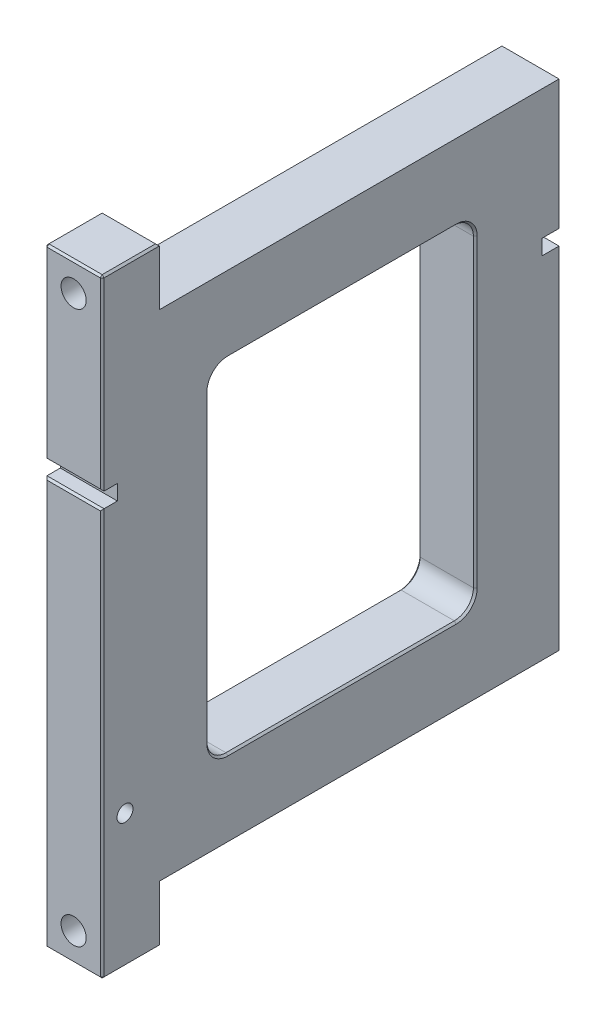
ISO-10303-21;
HEADER;
FILE_DESCRIPTION(('STEP AP214'),'2;1');
FILE_NAME('part.step','',(''),(''),'','','');
FILE_SCHEMA(('AUTOMOTIVE_DESIGN { 1 0 10303 214 1 1 1 1 }'));
ENDSEC;
DATA;
#1=APPLICATION_CONTEXT('core data for automotive mechanical design processes');
#2=APPLICATION_PROTOCOL_DEFINITION('international standard','automotive_design',2000,#1);
#3=PRODUCT_CONTEXT('',#1,'mechanical');
#4=PRODUCT('Part','Part','',(#3));
#5=PRODUCT_RELATED_PRODUCT_CATEGORY('part','',(#4));
#6=PRODUCT_DEFINITION_FORMATION('','',#4);
#7=PRODUCT_DEFINITION_CONTEXT('part definition',#1,'design');
#8=PRODUCT_DEFINITION('design','',#6,#7);
#9=PRODUCT_DEFINITION_SHAPE('','',#8);
#10=(LENGTH_UNIT() NAMED_UNIT(*) SI_UNIT(.MILLI.,.METRE.));
#11=(NAMED_UNIT(*) PLANE_ANGLE_UNIT() SI_UNIT($,.RADIAN.));
#12=(NAMED_UNIT(*) SI_UNIT($,.STERADIAN.) SOLID_ANGLE_UNIT());
#13=UNCERTAINTY_MEASURE_WITH_UNIT(LENGTH_MEASURE(1.E-05),#10,'distance_accuracy_value','');
#14=(GEOMETRIC_REPRESENTATION_CONTEXT(3) GLOBAL_UNCERTAINTY_ASSIGNED_CONTEXT((#13)) GLOBAL_UNIT_ASSIGNED_CONTEXT((#10,
#11,#12)) REPRESENTATION_CONTEXT('',''));
#15=CARTESIAN_POINT('',(0.,0.,0.));
#16=DIRECTION('',(0.,0.,1.));
#17=DIRECTION('',(1.,0.,0.));
#18=AXIS2_PLACEMENT_3D('',#15,#16,#17);
#19=CARTESIAN_POINT('',(467.220096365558,20.96,166.49));
#20=DIRECTION('',(0.,0.,1.));
#21=DIRECTION('',(0.,-1.,0.));
#22=AXIS2_PLACEMENT_3D('',#19,#20,#21);
#23=PLANE('',#22);
#24=DIRECTION('',(1.,0.,0.));
#25=VECTOR('',#24,1.);
#26=CARTESIAN_POINT('',(467.220096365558,-138.54,166.49));
#27=LINE('',#26,#25);
#28=CARTESIAN_POINT('',(467.720096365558,-138.54,166.49));
#29=VERTEX_POINT('',#28);
#30=CARTESIAN_POINT('',(481.720096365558,-138.54,166.49));
#31=VERTEX_POINT('',#30);
#32=EDGE_CURVE('E577',#29,#31,#27,.T.);
#33=ORIENTED_EDGE('',*,*,#32,.T.);
#34=DIRECTION('',(0.,1.,0.));
#35=VECTOR('',#34,1.);
#36=CARTESIAN_POINT('',(481.720096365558,20.96,166.49));
#37=LINE('',#36,#35);
#38=CARTESIAN_POINT('',(481.720096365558,-32.54,166.49));
#39=VERTEX_POINT('',#38);
#40=EDGE_CURVE('E583',#31,#39,#37,.T.);
#41=ORIENTED_EDGE('',*,*,#40,.T.);
#42=DIRECTION('',(-1.,0.,0.));
#43=VECTOR('',#42,1.);
#44=CARTESIAN_POINT('',(467.220096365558,-32.54,166.49));
#45=LINE('',#44,#43);
#46=CARTESIAN_POINT('',(467.720096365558,-32.54,166.49));
#47=VERTEX_POINT('',#46);
#48=EDGE_CURVE('E581',#39,#47,#45,.T.);
#49=ORIENTED_EDGE('',*,*,#48,.T.);
#50=DIRECTION('',(0.,-1.,0.));
#51=VECTOR('',#50,1.);
#52=CARTESIAN_POINT('',(467.720096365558,-139.04,166.49));
#53=LINE('',#52,#51);
#54=EDGE_CURVE('E579',#47,#29,#53,.T.);
#55=ORIENTED_EDGE('',*,*,#54,.T.);
#56=EDGE_LOOP('',(#33,#41,#49,#55));
#57=FACE_BOUND('',#56,.T.);
#58=CARTESIAN_POINT('',(474.720096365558,-131.54,166.49));
#59=DIRECTION('',(0.,0.,1.));
#60=DIRECTION('',(1.,0.,0.));
#61=AXIS2_PLACEMENT_3D('',#58,#59,#60);
#62=CIRCLE('',#61,3.3);
#63=CARTESIAN_POINT('',(478.020096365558,-131.54,166.49));
#64=VERTEX_POINT('',#63);
#65=EDGE_CURVE('E336',#64,#64,#62,.T.);
#66=ORIENTED_EDGE('',*,*,#65,.F.);
#67=EDGE_LOOP('',(#66));
#68=FACE_BOUND('',#67,.T.);
#69=ADVANCED_FACE('F16',(#57,#68),#23,.T.);
#70=CARTESIAN_POINT('',(467.220096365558,-139.04,45.99));
#71=DIRECTION('',(0.,0.,-1.));
#72=DIRECTION('',(-1.,0.,0.));
#73=AXIS2_PLACEMENT_3D('',#70,#71,#72);
#74=PLANE('',#73);
#75=DIRECTION('',(-1.,0.,0.));
#76=VECTOR('',#75,1.);
#77=CARTESIAN_POINT('',(467.220096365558,-27.54,45.99));
#78=LINE('',#77,#76);
#79=CARTESIAN_POINT('',(481.720096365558,-27.54,45.99));
#80=VERTEX_POINT('',#79);
#81=CARTESIAN_POINT('',(467.720096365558,-27.54,45.99));
#82=VERTEX_POINT('',#81);
#83=EDGE_CURVE('E555',#80,#82,#78,.T.);
#84=ORIENTED_EDGE('',*,*,#83,.T.);
#85=DIRECTION('',(0.,1.,0.));
#86=VECTOR('',#85,1.);
#87=CARTESIAN_POINT('',(467.720096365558,5.96,45.99));
#88=LINE('',#87,#86);
#89=CARTESIAN_POINT('',(467.720096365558,5.46,45.99));
#90=VERTEX_POINT('',#89);
#91=EDGE_CURVE('E559',#82,#90,#88,.T.);
#92=ORIENTED_EDGE('',*,*,#91,.T.);
#93=DIRECTION('',(1.,0.,0.));
#94=VECTOR('',#93,1.);
#95=CARTESIAN_POINT('',(482.220096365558,5.46,45.99));
#96=LINE('',#95,#94);
#97=CARTESIAN_POINT('',(481.720096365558,5.46,45.99));
#98=VERTEX_POINT('',#97);
#99=EDGE_CURVE('E557',#90,#98,#96,.T.);
#100=ORIENTED_EDGE('',*,*,#99,.T.);
#101=DIRECTION('',(0.,-1.,0.));
#102=VECTOR('',#101,1.);
#103=CARTESIAN_POINT('',(481.720096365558,-139.04,45.99));
#104=LINE('',#103,#102);
#105=EDGE_CURVE('E553',#98,#80,#104,.T.);
#106=ORIENTED_EDGE('',*,*,#105,.T.);
#107=EDGE_LOOP('',(#84,#92,#100,#106));
#108=FACE_BOUND('',#107,.T.);
#109=CARTESIAN_POINT('',(474.720096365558,-11.04,45.99));
#110=DIRECTION('',(0.,0.,-1.));
#111=DIRECTION('',(-1.,0.,0.));
#112=AXIS2_PLACEMENT_3D('',#109,#110,#111);
#113=CIRCLE('',#112,2.1);
#114=CARTESIAN_POINT('',(472.620096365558,-11.04,45.99));
#115=VERTEX_POINT('',#114);
#116=EDGE_CURVE('E315',#115,#115,#113,.T.);
#117=ORIENTED_EDGE('',*,*,#116,.F.);
#118=EDGE_LOOP('',(#117));
#119=FACE_BOUND('',#118,.T.);
#120=ADVANCED_FACE('F767',(#108,#119),#74,.T.);
#121=DIRECTION('',(-1.,0.,0.));
#122=VECTOR('',#121,1.);
#123=CARTESIAN_POINT('',(467.220096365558,20.46,166.49));
#124=LINE('',#123,#122);
#125=CARTESIAN_POINT('',(481.720096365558,20.46,166.49));
#126=VERTEX_POINT('',#125);
#127=CARTESIAN_POINT('',(467.720096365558,20.46,166.49));
#128=VERTEX_POINT('',#127);
#129=EDGE_CURVE('E588',#126,#128,#124,.T.);
#130=ORIENTED_EDGE('',*,*,#129,.T.);
#131=DIRECTION('',(0.,-1.,0.));
#132=VECTOR('',#131,1.);
#133=CARTESIAN_POINT('',(467.720096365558,-28.04,166.49));
#134=LINE('',#133,#132);
#135=CARTESIAN_POINT('',(467.720096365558,-27.54,166.49));
#136=VERTEX_POINT('',#135);
#137=EDGE_CURVE('E594',#128,#136,#134,.T.);
#138=ORIENTED_EDGE('',*,*,#137,.T.);
#139=DIRECTION('',(1.,0.,0.));
#140=VECTOR('',#139,1.);
#141=CARTESIAN_POINT('',(482.220096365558,-27.54,166.49));
#142=LINE('',#141,#140);
#143=CARTESIAN_POINT('',(481.720096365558,-27.54,166.49));
#144=VERTEX_POINT('',#143);
#145=EDGE_CURVE('E592',#136,#144,#142,.T.);
#146=ORIENTED_EDGE('',*,*,#145,.T.);
#147=DIRECTION('',(0.,1.,0.));
#148=VECTOR('',#147,1.);
#149=CARTESIAN_POINT('',(481.720096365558,20.96,166.49));
#150=LINE('',#149,#148);
#151=EDGE_CURVE('E590',#144,#126,#150,.T.);
#152=ORIENTED_EDGE('',*,*,#151,.T.);
#153=EDGE_LOOP('',(#130,#138,#146,#152));
#154=FACE_BOUND('',#153,.T.);
#155=CARTESIAN_POINT('',(474.720096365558,13.46,166.49));
#156=DIRECTION('',(0.,0.,1.));
#157=DIRECTION('',(1.,0.,0.));
#158=AXIS2_PLACEMENT_3D('',#155,#156,#157);
#159=CIRCLE('',#158,3.3);
#160=CARTESIAN_POINT('',(478.020096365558,13.46,166.49));
#161=VERTEX_POINT('',#160);
#162=EDGE_CURVE('E332',#161,#161,#159,.T.);
#163=ORIENTED_EDGE('',*,*,#162,.F.);
#164=EDGE_LOOP('',(#163));
#165=FACE_BOUND('',#164,.T.);
#166=ADVANCED_FACE('F749',(#154,#165),#23,.T.);
#167=CARTESIAN_POINT('',(467.220096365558,20.96,45.99));
#168=DIRECTION('',(0.,1.,0.));
#169=DIRECTION('',(0.,0.,1.));
#170=AXIS2_PLACEMENT_3D('',#167,#168,#169);
#171=PLANE('',#170);
#172=DIRECTION('',(1.,0.,0.));
#173=VECTOR('',#172,1.);
#174=CARTESIAN_POINT('',(467.220096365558,20.96,165.99));
#175=LINE('',#174,#173);
#176=CARTESIAN_POINT('',(467.720096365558,20.96,165.99));
#177=VERTEX_POINT('',#176);
#178=CARTESIAN_POINT('',(481.720096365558,20.96,165.99));
#179=VERTEX_POINT('',#178);
#180=EDGE_CURVE('E599',#177,#179,#175,.T.);
#181=ORIENTED_EDGE('',*,*,#180,.T.);
#182=DIRECTION('',(0.,0.,-1.));
#183=VECTOR('',#182,1.);
#184=CARTESIAN_POINT('',(481.720096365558,20.96,45.99));
#185=LINE('',#184,#183);
#186=CARTESIAN_POINT('',(481.720096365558,20.96,151.99));
#187=VERTEX_POINT('',#186);
#188=EDGE_CURVE('E25',#179,#187,#185,.T.);
#189=ORIENTED_EDGE('',*,*,#188,.T.);
#190=DIRECTION('',(-1.,0.,0.));
#191=VECTOR('',#190,1.);
#192=CARTESIAN_POINT('',(467.220096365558,20.96,151.99));
#193=LINE('',#192,#191);
#194=CARTESIAN_POINT('',(467.720096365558,20.96,151.99));
#195=VERTEX_POINT('',#194);
#196=EDGE_CURVE('E33',#187,#195,#193,.T.);
#197=ORIENTED_EDGE('',*,*,#196,.T.);
#198=DIRECTION('',(0.,0.,1.));
#199=VECTOR('',#198,1.);
#200=CARTESIAN_POINT('',(467.720096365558,20.96,166.49));
#201=LINE('',#200,#199);
#202=EDGE_CURVE('E601',#195,#177,#201,.T.);
#203=ORIENTED_EDGE('',*,*,#202,.T.);
#204=EDGE_LOOP('',(#181,#189,#197,#203));
#205=FACE_BOUND('',#204,.T.);
#206=ADVANCED_FACE('F728',(#205),#171,.T.);
#207=DIRECTION('',(1.,0.,0.));
#208=VECTOR('',#207,1.);
#209=CARTESIAN_POINT('',(482.220096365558,-32.54,45.99));
#210=LINE('',#209,#208);
#211=CARTESIAN_POINT('',(467.720096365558,-32.54,45.99));
#212=VERTEX_POINT('',#211);
#213=CARTESIAN_POINT('',(481.720096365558,-32.54,45.99));
#214=VERTEX_POINT('',#213);
#215=EDGE_CURVE('E476',#212,#214,#210,.T.);
#216=ORIENTED_EDGE('',*,*,#215,.T.);
#217=DIRECTION('',(0.,-1.,0.));
#218=VECTOR('',#217,1.);
#219=CARTESIAN_POINT('',(481.720096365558,-139.04,45.99));
#220=LINE('',#219,#218);
#221=CARTESIAN_POINT('',(481.720096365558,-123.54,45.99));
#222=VERTEX_POINT('',#221);
#223=EDGE_CURVE('E480',#214,#222,#220,.T.);
#224=ORIENTED_EDGE('',*,*,#223,.T.);
#225=DIRECTION('',(-1.,0.,0.));
#226=VECTOR('',#225,1.);
#227=CARTESIAN_POINT('',(467.220096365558,-123.54,45.99));
#228=LINE('',#227,#226);
#229=CARTESIAN_POINT('',(467.720096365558,-123.54,45.99));
#230=VERTEX_POINT('',#229);
#231=EDGE_CURVE('E478',#222,#230,#228,.T.);
#232=ORIENTED_EDGE('',*,*,#231,.T.);
#233=DIRECTION('',(0.,1.,0.));
#234=VECTOR('',#233,1.);
#235=CARTESIAN_POINT('',(467.720096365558,-32.04,45.99));
#236=LINE('',#235,#234);
#237=EDGE_CURVE('E474',#230,#212,#236,.T.);
#238=ORIENTED_EDGE('',*,*,#237,.T.);
#239=EDGE_LOOP('',(#216,#224,#232,#238));
#240=FACE_BOUND('',#239,.T.);
#241=CARTESIAN_POINT('',(474.720096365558,-107.04,45.99));
#242=DIRECTION('',(0.,0.,-1.));
#243=DIRECTION('',(-1.,0.,0.));
#244=AXIS2_PLACEMENT_3D('',#241,#242,#243);
#245=CIRCLE('',#244,2.1);
#246=CARTESIAN_POINT('',(472.620096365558,-107.04,45.99));
#247=VERTEX_POINT('',#246);
#248=EDGE_CURVE('E314',#247,#247,#245,.T.);
#249=ORIENTED_EDGE('',*,*,#248,.F.);
#250=EDGE_LOOP('',(#249));
#251=FACE_BOUND('',#250,.T.);
#252=CARTESIAN_POINT('',(474.720096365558,-59.04,45.99));
#253=DIRECTION('',(0.,0.,-1.));
#254=DIRECTION('',(-1.,0.,0.));
#255=AXIS2_PLACEMENT_3D('',#252,#253,#254);
#256=CIRCLE('',#255,2.1);
#257=CARTESIAN_POINT('',(472.620096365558,-59.04,45.99));
#258=VERTEX_POINT('',#257);
#259=EDGE_CURVE('E326',#258,#258,#256,.T.);
#260=ORIENTED_EDGE('',*,*,#259,.F.);
#261=EDGE_LOOP('',(#260));
#262=FACE_BOUND('',#261,.T.);
#263=ADVANCED_FACE('F776',(#240,#251,#262),#74,.T.);
#264=CARTESIAN_POINT('',(467.220096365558,-139.04,166.49));
#265=DIRECTION('',(0.,-1.,0.));
#266=DIRECTION('',(0.,0.,-1.));
#267=AXIS2_PLACEMENT_3D('',#264,#265,#266);
#268=PLANE('',#267);
#269=DIRECTION('',(-1.,0.,0.));
#270=VECTOR('',#269,1.);
#271=CARTESIAN_POINT('',(467.220096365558,-139.04,165.99));
#272=LINE('',#271,#270);
#273=CARTESIAN_POINT('',(481.720096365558,-139.04,165.99));
#274=VERTEX_POINT('',#273);
#275=CARTESIAN_POINT('',(467.720096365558,-139.04,165.99));
#276=VERTEX_POINT('',#275);
#277=EDGE_CURVE('E566',#274,#276,#272,.T.);
#278=ORIENTED_EDGE('',*,*,#277,.T.);
#279=DIRECTION('',(0.,0.,-1.));
#280=VECTOR('',#279,1.);
#281=CARTESIAN_POINT('',(467.720096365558,-139.04,151.49));
#282=LINE('',#281,#280);
#283=CARTESIAN_POINT('',(467.720096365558,-139.04,151.99));
#284=VERTEX_POINT('',#283);
#285=EDGE_CURVE('E572',#276,#284,#282,.T.);
#286=ORIENTED_EDGE('',*,*,#285,.T.);
#287=DIRECTION('',(1.,0.,0.));
#288=VECTOR('',#287,1.);
#289=CARTESIAN_POINT('',(482.220096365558,-139.04,151.99));
#290=LINE('',#289,#288);
#291=CARTESIAN_POINT('',(481.720096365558,-139.04,151.99));
#292=VERTEX_POINT('',#291);
#293=EDGE_CURVE('E570',#284,#292,#290,.T.);
#294=ORIENTED_EDGE('',*,*,#293,.T.);
#295=DIRECTION('',(0.,0.,1.));
#296=VECTOR('',#295,1.);
#297=CARTESIAN_POINT('',(481.720096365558,-139.04,166.49));
#298=LINE('',#297,#296);
#299=EDGE_CURVE('E568',#292,#274,#298,.T.);
#300=ORIENTED_EDGE('',*,*,#299,.T.);
#301=EDGE_LOOP('',(#278,#286,#294,#300));
#302=FACE_BOUND('',#301,.T.);
#303=ADVANCED_FACE('F790',(#302),#268,.T.);
#304=CARTESIAN_POINT('',(467.220096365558,0.,0.));
#305=DIRECTION('',(1.,0.,0.));
#306=DIRECTION('',(0.,0.,-1.));
#307=AXIS2_PLACEMENT_3D('',#304,#305,#306);
#308=PLANE('',#307);
#309=DIRECTION('',(0.,0.,1.));
#310=VECTOR('',#309,1.);
#311=CARTESIAN_POINT('',(467.220096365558,-13.54,0.));
#312=LINE('',#311,#310);
#313=CARTESIAN_POINT('',(467.220096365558,-13.54,73.49));
#314=VERTEX_POINT('',#313);
#315=CARTESIAN_POINT('',(467.220096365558,-13.54,133.49));
#316=VERTEX_POINT('',#315);
#317=EDGE_CURVE('E510',#314,#316,#312,.T.);
#318=ORIENTED_EDGE('',*,*,#317,.T.);
#319=CARTESIAN_POINT('',(467.220096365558,-19.04,133.49));
#320=DIRECTION('',(1.,0.,0.));
#321=DIRECTION('',(0.,0.,-1.));
#322=AXIS2_PLACEMENT_3D('',#319,#320,#321);
#323=CIRCLE('',#322,5.5);
#324=CARTESIAN_POINT('',(467.220096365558,-19.04,138.99));
#325=VERTEX_POINT('',#324);
#326=EDGE_CURVE('E514',#316,#325,#323,.T.);
#327=ORIENTED_EDGE('',*,*,#326,.T.);
#328=DIRECTION('',(0.,-1.,0.));
#329=VECTOR('',#328,1.);
#330=CARTESIAN_POINT('',(467.220096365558,0.,138.99));
#331=LINE('',#330,#329);
#332=CARTESIAN_POINT('',(467.220096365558,-99.04,138.99));
#333=VERTEX_POINT('',#332);
#334=EDGE_CURVE('E512',#325,#333,#331,.T.);
#335=ORIENTED_EDGE('',*,*,#334,.T.);
#336=CARTESIAN_POINT('',(467.220096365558,-99.04,133.49));
#337=DIRECTION('',(1.,0.,0.));
#338=DIRECTION('',(0.,0.,-1.));
#339=AXIS2_PLACEMENT_3D('',#336,#337,#338);
#340=CIRCLE('',#339,5.5);
#341=CARTESIAN_POINT('',(467.220096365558,-104.54,133.49));
#342=VERTEX_POINT('',#341);
#343=EDGE_CURVE('E508',#333,#342,#340,.T.);
#344=ORIENTED_EDGE('',*,*,#343,.T.);
#345=DIRECTION('',(0.,0.,-1.));
#346=VECTOR('',#345,1.);
#347=CARTESIAN_POINT('',(467.220096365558,-104.54,0.));
#348=LINE('',#347,#346);
#349=CARTESIAN_POINT('',(467.220096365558,-104.54,73.49));
#350=VERTEX_POINT('',#349);
#351=EDGE_CURVE('E504',#342,#350,#348,.T.);
#352=ORIENTED_EDGE('',*,*,#351,.T.);
#353=CARTESIAN_POINT('',(467.220096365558,-99.04,73.49));
#354=DIRECTION('',(1.,0.,0.));
#355=DIRECTION('',(0.,0.,-1.));
#356=AXIS2_PLACEMENT_3D('',#353,#354,#355);
#357=CIRCLE('',#356,5.5);
#358=CARTESIAN_POINT('',(467.220096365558,-99.04,67.99));
#359=VERTEX_POINT('',#358);
#360=EDGE_CURVE('E500',#350,#359,#357,.T.);
#361=ORIENTED_EDGE('',*,*,#360,.T.);
#362=DIRECTION('',(0.,1.,0.));
#363=VECTOR('',#362,1.);
#364=CARTESIAN_POINT('',(467.220096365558,0.,67.99));
#365=LINE('',#364,#363);
#366=CARTESIAN_POINT('',(467.220096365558,-19.04,67.99));
#367=VERTEX_POINT('',#366);
#368=EDGE_CURVE('E502',#359,#367,#365,.T.);
#369=ORIENTED_EDGE('',*,*,#368,.T.);
#370=CARTESIAN_POINT('',(467.220096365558,-19.04,73.49));
#371=DIRECTION('',(1.,0.,0.));
#372=DIRECTION('',(0.,0.,-1.));
#373=AXIS2_PLACEMENT_3D('',#370,#371,#372);
#374=CIRCLE('',#373,5.5);
#375=EDGE_CURVE('E506',#367,#314,#374,.T.);
#376=ORIENTED_EDGE('',*,*,#375,.T.);
#377=EDGE_LOOP('',(#318,#327,#335,#344,#352,#361,#369,#376));
#378=FACE_BOUND('',#377,.T.);
#379=CARTESIAN_POINT('',(467.220096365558,-104.04,160.49));
#380=DIRECTION('',(-1.,0.,0.));
#381=DIRECTION('',(0.,0.,1.));
#382=AXIS2_PLACEMENT_3D('',#379,#380,#381);
#383=CIRCLE('',#382,2.1);
#384=CARTESIAN_POINT('',(467.220096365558,-104.04,162.59));
#385=VERTEX_POINT('',#384);
#386=EDGE_CURVE('E340',#385,#385,#383,.T.);
#387=ORIENTED_EDGE('',*,*,#386,.F.);
#388=EDGE_LOOP('',(#387));
#389=FACE_BOUND('',#388,.T.);
#390=DIRECTION('',(0.,0.,1.));
#391=VECTOR('',#390,1.);
#392=CARTESIAN_POINT('',(467.220096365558,-32.04,45.99));
#393=LINE('',#392,#391);
#394=CARTESIAN_POINT('',(467.220096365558,-32.04,46.49));
#395=VERTEX_POINT('',#394);
#396=CARTESIAN_POINT('',(467.220096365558,-32.04,50.99));
#397=VERTEX_POINT('',#396);
#398=EDGE_CURVE('E376',#395,#397,#393,.T.);
#399=ORIENTED_EDGE('',*,*,#398,.F.);
#400=DIRECTION('',(0.,-1.,0.));
#401=VECTOR('',#400,1.);
#402=CARTESIAN_POINT('',(467.220096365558,-124.04,46.49));
#403=LINE('',#402,#401);
#404=CARTESIAN_POINT('',(467.220096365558,-124.04,46.49));
#405=VERTEX_POINT('',#404);
#406=EDGE_CURVE('E517',#395,#405,#403,.T.);
#407=ORIENTED_EDGE('',*,*,#406,.T.);
#408=DIRECTION('',(0.,0.,-1.));
#409=VECTOR('',#408,1.);
#410=CARTESIAN_POINT('',(467.220096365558,-124.04,151.49));
#411=LINE('',#410,#409);
#412=CARTESIAN_POINT('',(467.220096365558,-124.04,151.49));
#413=VERTEX_POINT('',#412);
#414=EDGE_CURVE('E401',#413,#405,#411,.T.);
#415=ORIENTED_EDGE('',*,*,#414,.F.);
#416=DIRECTION('',(0.,1.,0.));
#417=VECTOR('',#416,1.);
#418=CARTESIAN_POINT('',(467.220096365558,-139.04,151.49));
#419=LINE('',#418,#417);
#420=CARTESIAN_POINT('',(467.220096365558,-138.54,151.49));
#421=VERTEX_POINT('',#420);
#422=EDGE_CURVE('E395',#421,#413,#419,.T.);
#423=ORIENTED_EDGE('',*,*,#422,.F.);
#424=DIRECTION('',(0.,0.,1.));
#425=VECTOR('',#424,1.);
#426=CARTESIAN_POINT('',(467.220096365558,-138.54,166.49));
#427=LINE('',#426,#425);
#428=CARTESIAN_POINT('',(467.220096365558,-138.54,165.99));
#429=VERTEX_POINT('',#428);
#430=EDGE_CURVE('E494',#421,#429,#427,.T.);
#431=ORIENTED_EDGE('',*,*,#430,.T.);
#432=DIRECTION('',(0.,1.,0.));
#433=VECTOR('',#432,1.);
#434=CARTESIAN_POINT('',(467.220096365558,-32.04,165.99));
#435=LINE('',#434,#433);
#436=CARTESIAN_POINT('',(467.220096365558,-32.04,165.99));
#437=VERTEX_POINT('',#436);
#438=EDGE_CURVE('E492',#429,#437,#435,.T.);
#439=ORIENTED_EDGE('',*,*,#438,.T.);
#440=DIRECTION('',(0.,0.,1.));
#441=VECTOR('',#440,1.);
#442=CARTESIAN_POINT('',(467.220096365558,-32.04,162.49));
#443=LINE('',#442,#441);
#444=CARTESIAN_POINT('',(467.220096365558,-32.04,162.49));
#445=VERTEX_POINT('',#444);
#446=EDGE_CURVE('E346',#445,#437,#443,.T.);
#447=ORIENTED_EDGE('',*,*,#446,.F.);
#448=DIRECTION('',(0.,-1.,0.));
#449=VECTOR('',#448,1.);
#450=CARTESIAN_POINT('',(467.220096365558,-28.04,162.49));
#451=LINE('',#450,#449);
#452=CARTESIAN_POINT('',(467.220096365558,-28.04,162.49));
#453=VERTEX_POINT('',#452);
#454=EDGE_CURVE('E351',#453,#445,#451,.T.);
#455=ORIENTED_EDGE('',*,*,#454,.F.);
#456=DIRECTION('',(0.,0.,-1.));
#457=VECTOR('',#456,1.);
#458=CARTESIAN_POINT('',(467.220096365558,-28.04,167.49));
#459=LINE('',#458,#457);
#460=CARTESIAN_POINT('',(467.220096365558,-28.04,165.99));
#461=VERTEX_POINT('',#460);
#462=EDGE_CURVE('E357',#461,#453,#459,.T.);
#463=ORIENTED_EDGE('',*,*,#462,.F.);
#464=DIRECTION('',(0.,1.,0.));
#465=VECTOR('',#464,1.);
#466=CARTESIAN_POINT('',(467.220096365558,20.96,165.99));
#467=LINE('',#466,#465);
#468=CARTESIAN_POINT('',(467.220096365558,20.46,165.99));
#469=VERTEX_POINT('',#468);
#470=EDGE_CURVE('E489',#461,#469,#467,.T.);
#471=ORIENTED_EDGE('',*,*,#470,.T.);
#472=DIRECTION('',(0.,0.,-1.));
#473=VECTOR('',#472,1.);
#474=CARTESIAN_POINT('',(467.220096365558,20.46,151.49));
#475=LINE('',#474,#473);
#476=CARTESIAN_POINT('',(467.220096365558,20.46,151.49));
#477=VERTEX_POINT('',#476);
#478=EDGE_CURVE('E487',#469,#477,#475,.T.);
#479=ORIENTED_EDGE('',*,*,#478,.T.);
#480=DIRECTION('',(0.,1.,0.));
#481=VECTOR('',#480,1.);
#482=CARTESIAN_POINT('',(467.220096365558,5.96,151.49));
#483=LINE('',#482,#481);
#484=CARTESIAN_POINT('',(467.220096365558,5.96,151.49));
#485=VERTEX_POINT('',#484);
#486=EDGE_CURVE('E370',#485,#477,#483,.T.);
#487=ORIENTED_EDGE('',*,*,#486,.F.);
#488=DIRECTION('',(0.,0.,1.));
#489=VECTOR('',#488,1.);
#490=CARTESIAN_POINT('',(467.220096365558,5.96,39.49));
#491=LINE('',#490,#489);
#492=CARTESIAN_POINT('',(467.220096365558,5.96,46.49));
#493=VERTEX_POINT('',#492);
#494=EDGE_CURVE('E363',#493,#485,#491,.T.);
#495=ORIENTED_EDGE('',*,*,#494,.F.);
#496=DIRECTION('',(0.,-1.,0.));
#497=VECTOR('',#496,1.);
#498=CARTESIAN_POINT('',(467.220096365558,-28.04,46.49));
#499=LINE('',#498,#497);
#500=CARTESIAN_POINT('',(467.220096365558,-28.04,46.49));
#501=VERTEX_POINT('',#500);
#502=EDGE_CURVE('E497',#493,#501,#499,.T.);
#503=ORIENTED_EDGE('',*,*,#502,.T.);
#504=DIRECTION('',(0.,0.,-1.));
#505=VECTOR('',#504,1.);
#506=CARTESIAN_POINT('',(467.220096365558,-28.04,50.99));
#507=LINE('',#506,#505);
#508=CARTESIAN_POINT('',(467.220096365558,-28.04,50.99));
#509=VERTEX_POINT('',#508);
#510=EDGE_CURVE('E380',#509,#501,#507,.T.);
#511=ORIENTED_EDGE('',*,*,#510,.F.);
#512=DIRECTION('',(0.,1.,0.));
#513=VECTOR('',#512,1.);
#514=CARTESIAN_POINT('',(467.220096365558,-32.04,50.99));
#515=LINE('',#514,#513);
#516=EDGE_CURVE('E388',#397,#509,#515,.T.);
#517=ORIENTED_EDGE('',*,*,#516,.F.);
#518=EDGE_LOOP('',(#399,#407,#415,#423,#431,#439,#447,#455,#463,#471,#479,#487,#495,#503,#511,#517));
#519=FACE_BOUND('',#518,.T.);
#520=ADVANCED_FACE('F796',(#378,#389,#519),#308,.F.);
#521=CARTESIAN_POINT('',(482.220096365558,0.,0.));
#522=DIRECTION('',(1.,0.,0.));
#523=DIRECTION('',(0.,0.,-1.));
#524=AXIS2_PLACEMENT_3D('',#521,#522,#523);
#525=PLANE('',#524);
#526=DIRECTION('',(0.,0.,1.));
#527=VECTOR('',#526,1.);
#528=CARTESIAN_POINT('',(482.220096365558,-104.54,133.49));
#529=LINE('',#528,#527);
#530=CARTESIAN_POINT('',(482.220096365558,-104.54,73.49));
#531=VERTEX_POINT('',#530);
#532=CARTESIAN_POINT('',(482.220096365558,-104.54,133.49));
#533=VERTEX_POINT('',#532);
#534=EDGE_CURVE('E464',#531,#533,#529,.T.);
#535=ORIENTED_EDGE('',*,*,#534,.T.);
#536=CARTESIAN_POINT('',(482.220096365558,-99.04,133.49));
#537=DIRECTION('',(1.,0.,0.));
#538=DIRECTION('',(0.,0.,-1.));
#539=AXIS2_PLACEMENT_3D('',#536,#537,#538);
#540=CIRCLE('',#539,5.5);
#541=CARTESIAN_POINT('',(482.220096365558,-99.04,138.99));
#542=VERTEX_POINT('',#541);
#543=EDGE_CURVE('E468',#533,#542,#540,.F.);
#544=ORIENTED_EDGE('',*,*,#543,.T.);
#545=DIRECTION('',(0.,1.,0.));
#546=VECTOR('',#545,1.);
#547=CARTESIAN_POINT('',(482.220096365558,-19.04,138.99));
#548=LINE('',#547,#546);
#549=CARTESIAN_POINT('',(482.220096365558,-19.04,138.99));
#550=VERTEX_POINT('',#549);
#551=EDGE_CURVE('E466',#542,#550,#548,.T.);
#552=ORIENTED_EDGE('',*,*,#551,.T.);
#553=CARTESIAN_POINT('',(482.220096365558,-19.04,133.49));
#554=DIRECTION('',(1.,0.,0.));
#555=DIRECTION('',(0.,0.,-1.));
#556=AXIS2_PLACEMENT_3D('',#553,#554,#555);
#557=CIRCLE('',#556,5.5);
#558=CARTESIAN_POINT('',(482.220096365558,-13.54,133.49));
#559=VERTEX_POINT('',#558);
#560=EDGE_CURVE('E462',#550,#559,#557,.F.);
#561=ORIENTED_EDGE('',*,*,#560,.T.);
#562=DIRECTION('',(0.,0.,-1.));
#563=VECTOR('',#562,1.);
#564=CARTESIAN_POINT('',(482.220096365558,-13.54,73.49));
#565=LINE('',#564,#563);
#566=CARTESIAN_POINT('',(482.220096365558,-13.54,73.49));
#567=VERTEX_POINT('',#566);
#568=EDGE_CURVE('E458',#559,#567,#565,.T.);
#569=ORIENTED_EDGE('',*,*,#568,.T.);
#570=CARTESIAN_POINT('',(482.220096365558,-19.04,73.49));
#571=DIRECTION('',(1.,0.,0.));
#572=DIRECTION('',(0.,0.,-1.));
#573=AXIS2_PLACEMENT_3D('',#570,#571,#572);
#574=CIRCLE('',#573,5.5);
#575=CARTESIAN_POINT('',(482.220096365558,-19.04,67.99));
#576=VERTEX_POINT('',#575);
#577=EDGE_CURVE('E454',#567,#576,#574,.F.);
#578=ORIENTED_EDGE('',*,*,#577,.T.);
#579=DIRECTION('',(0.,-1.,0.));
#580=VECTOR('',#579,1.);
#581=CARTESIAN_POINT('',(482.220096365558,-99.04,67.99));
#582=LINE('',#581,#580);
#583=CARTESIAN_POINT('',(482.220096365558,-99.04,67.99));
#584=VERTEX_POINT('',#583);
#585=EDGE_CURVE('E456',#576,#584,#582,.T.);
#586=ORIENTED_EDGE('',*,*,#585,.T.);
#587=CARTESIAN_POINT('',(482.220096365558,-99.04,73.49));
#588=DIRECTION('',(1.,0.,0.));
#589=DIRECTION('',(0.,0.,-1.));
#590=AXIS2_PLACEMENT_3D('',#587,#588,#589);
#591=CIRCLE('',#590,5.5);
#592=EDGE_CURVE('E460',#584,#531,#591,.F.);
#593=ORIENTED_EDGE('',*,*,#592,.T.);
#594=EDGE_LOOP('',(#535,#544,#552,#561,#569,#578,#586,#593));
#595=FACE_BOUND('',#594,.T.);
#596=CARTESIAN_POINT('',(482.220096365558,-104.04,160.49));
#597=DIRECTION('',(-1.,0.,0.));
#598=DIRECTION('',(0.,0.,1.));
#599=AXIS2_PLACEMENT_3D('',#596,#597,#598);
#600=CIRCLE('',#599,2.1);
#601=CARTESIAN_POINT('',(482.220096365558,-104.04,162.59));
#602=VERTEX_POINT('',#601);
#603=EDGE_CURVE('E343',#602,#602,#600,.T.);
#604=ORIENTED_EDGE('',*,*,#603,.T.);
#605=EDGE_LOOP('',(#604));
#606=FACE_BOUND('',#605,.T.);
#607=DIRECTION('',(0.,0.,-1.));
#608=VECTOR('',#607,1.);
#609=CARTESIAN_POINT('',(482.220096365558,-124.04,151.49));
#610=LINE('',#609,#608);
#611=CARTESIAN_POINT('',(482.220096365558,-124.04,151.49));
#612=VERTEX_POINT('',#611);
#613=CARTESIAN_POINT('',(482.220096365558,-124.04,46.49));
#614=VERTEX_POINT('',#613);
#615=EDGE_CURVE('E400',#612,#614,#610,.T.);
#616=ORIENTED_EDGE('',*,*,#615,.T.);
#617=DIRECTION('',(0.,1.,0.));
#618=VECTOR('',#617,1.);
#619=CARTESIAN_POINT('',(482.220096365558,0.,46.49));
#620=LINE('',#619,#618);
#621=CARTESIAN_POINT('',(482.220096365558,-32.04,46.49));
#622=VERTEX_POINT('',#621);
#623=EDGE_CURVE('E471',#614,#622,#620,.T.);
#624=ORIENTED_EDGE('',*,*,#623,.T.);
#625=DIRECTION('',(0.,0.,1.));
#626=VECTOR('',#625,1.);
#627=CARTESIAN_POINT('',(482.220096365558,-32.04,45.99));
#628=LINE('',#627,#626);
#629=CARTESIAN_POINT('',(482.220096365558,-32.04,50.99));
#630=VERTEX_POINT('',#629);
#631=EDGE_CURVE('E377',#622,#630,#628,.T.);
#632=ORIENTED_EDGE('',*,*,#631,.T.);
#633=DIRECTION('',(0.,1.,0.));
#634=VECTOR('',#633,1.);
#635=CARTESIAN_POINT('',(482.220096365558,-32.04,50.99));
#636=LINE('',#635,#634);
#637=CARTESIAN_POINT('',(482.220096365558,-28.04,50.99));
#638=VERTEX_POINT('',#637);
#639=EDGE_CURVE('E379',#630,#638,#636,.T.);
#640=ORIENTED_EDGE('',*,*,#639,.T.);
#641=DIRECTION('',(0.,0.,-1.));
#642=VECTOR('',#641,1.);
#643=CARTESIAN_POINT('',(482.220096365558,-28.04,50.99));
#644=LINE('',#643,#642);
#645=CARTESIAN_POINT('',(482.220096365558,-28.04,46.49));
#646=VERTEX_POINT('',#645);
#647=EDGE_CURVE('E383',#638,#646,#644,.T.);
#648=ORIENTED_EDGE('',*,*,#647,.T.);
#649=DIRECTION('',(0.,1.,0.));
#650=VECTOR('',#649,1.);
#651=CARTESIAN_POINT('',(482.220096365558,0.,46.49));
#652=LINE('',#651,#650);
#653=CARTESIAN_POINT('',(482.220096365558,5.96,46.49));
#654=VERTEX_POINT('',#653);
#655=EDGE_CURVE('E452',#646,#654,#652,.T.);
#656=ORIENTED_EDGE('',*,*,#655,.T.);
#657=DIRECTION('',(0.,0.,-1.));
#658=VECTOR('',#657,1.);
#659=CARTESIAN_POINT('',(482.220096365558,5.96,0.));
#660=LINE('',#659,#658);
#661=CARTESIAN_POINT('',(482.220096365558,5.96,151.49));
#662=VERTEX_POINT('',#661);
#663=EDGE_CURVE('E410',#662,#654,#660,.T.);
#664=ORIENTED_EDGE('',*,*,#663,.F.);
#665=DIRECTION('',(0.,1.,0.));
#666=VECTOR('',#665,1.);
#667=CARTESIAN_POINT('',(482.220096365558,5.96,151.49));
#668=LINE('',#667,#666);
#669=CARTESIAN_POINT('',(482.220096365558,20.46,151.49));
#670=VERTEX_POINT('',#669);
#671=EDGE_CURVE('E366',#662,#670,#668,.T.);
#672=ORIENTED_EDGE('',*,*,#671,.T.);
#673=DIRECTION('',(0.,0.,1.));
#674=VECTOR('',#673,1.);
#675=CARTESIAN_POINT('',(482.220096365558,20.46,0.));
#676=LINE('',#675,#674);
#677=CARTESIAN_POINT('',(482.220096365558,20.46,165.99));
#678=VERTEX_POINT('',#677);
#679=EDGE_CURVE('E444',#670,#678,#676,.T.);
#680=ORIENTED_EDGE('',*,*,#679,.T.);
#681=DIRECTION('',(0.,-1.,0.));
#682=VECTOR('',#681,1.);
#683=CARTESIAN_POINT('',(482.220096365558,0.,165.99));
#684=LINE('',#683,#682);
#685=CARTESIAN_POINT('',(482.220096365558,-28.04,165.99));
#686=VERTEX_POINT('',#685);
#687=EDGE_CURVE('E446',#678,#686,#684,.T.);
#688=ORIENTED_EDGE('',*,*,#687,.T.);
#689=DIRECTION('',(0.,0.,1.));
#690=VECTOR('',#689,1.);
#691=CARTESIAN_POINT('',(482.220096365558,-28.04,0.));
#692=LINE('',#691,#690);
#693=CARTESIAN_POINT('',(482.220096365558,-28.04,162.49));
#694=VERTEX_POINT('',#693);
#695=EDGE_CURVE('E413',#694,#686,#692,.T.);
#696=ORIENTED_EDGE('',*,*,#695,.F.);
#697=DIRECTION('',(0.,-1.,0.));
#698=VECTOR('',#697,1.);
#699=CARTESIAN_POINT('',(482.220096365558,-28.04,162.49));
#700=LINE('',#699,#698);
#701=CARTESIAN_POINT('',(482.220096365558,-32.04,162.49));
#702=VERTEX_POINT('',#701);
#703=EDGE_CURVE('E350',#694,#702,#700,.T.);
#704=ORIENTED_EDGE('',*,*,#703,.T.);
#705=DIRECTION('',(0.,0.,1.));
#706=VECTOR('',#705,1.);
#707=CARTESIAN_POINT('',(482.220096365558,-32.04,162.49));
#708=LINE('',#707,#706);
#709=CARTESIAN_POINT('',(482.220096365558,-32.04,165.99));
#710=VERTEX_POINT('',#709);
#711=EDGE_CURVE('E347',#702,#710,#708,.T.);
#712=ORIENTED_EDGE('',*,*,#711,.T.);
#713=DIRECTION('',(0.,-1.,0.));
#714=VECTOR('',#713,1.);
#715=CARTESIAN_POINT('',(482.220096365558,0.,165.99));
#716=LINE('',#715,#714);
#717=CARTESIAN_POINT('',(482.220096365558,-138.54,165.99));
#718=VERTEX_POINT('',#717);
#719=EDGE_CURVE('E448',#710,#718,#716,.T.);
#720=ORIENTED_EDGE('',*,*,#719,.T.);
#721=DIRECTION('',(0.,0.,-1.));
#722=VECTOR('',#721,1.);
#723=CARTESIAN_POINT('',(482.220096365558,-138.54,0.));
#724=LINE('',#723,#722);
#725=CARTESIAN_POINT('',(482.220096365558,-138.54,151.49));
#726=VERTEX_POINT('',#725);
#727=EDGE_CURVE('E450',#718,#726,#724,.T.);
#728=ORIENTED_EDGE('',*,*,#727,.T.);
#729=DIRECTION('',(0.,1.,0.));
#730=VECTOR('',#729,1.);
#731=CARTESIAN_POINT('',(482.220096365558,-139.04,151.49));
#732=LINE('',#731,#730);
#733=EDGE_CURVE('E398',#726,#612,#732,.T.);
#734=ORIENTED_EDGE('',*,*,#733,.T.);
#735=EDGE_LOOP('',(#616,#624,#632,#640,#648,#656,#664,#672,#680,#688,#696,#704,#712,#720,#728,#734));
#736=FACE_BOUND('',#735,.T.);
#737=ADVANCED_FACE('F793',(#595,#606,#736),#525,.T.);
#738=CARTESIAN_POINT('',(482.220096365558,-124.04,151.49));
#739=DIRECTION('',(0.,1.,0.));
#740=DIRECTION('',(0.,0.,1.));
#741=AXIS2_PLACEMENT_3D('',#738,#739,#740);
#742=PLANE('',#741);
#743=ORIENTED_EDGE('',*,*,#414,.T.);
#744=DIRECTION('',(1.,0.,0.));
#745=VECTOR('',#744,1.);
#746=CARTESIAN_POINT('',(482.220096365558,-124.04,46.49));
#747=LINE('',#746,#745);
#748=EDGE_CURVE('E483',#405,#614,#747,.T.);
#749=ORIENTED_EDGE('',*,*,#748,.T.);
#750=ORIENTED_EDGE('',*,*,#615,.F.);
#751=DIRECTION('',(-1.,0.,0.));
#752=VECTOR('',#751,1.);
#753=CARTESIAN_POINT('',(482.220096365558,-124.04,151.49));
#754=LINE('',#753,#752);
#755=EDGE_CURVE('E404',#612,#413,#754,.T.);
#756=ORIENTED_EDGE('',*,*,#755,.T.);
#757=EDGE_LOOP('',(#743,#749,#750,#756));
#758=FACE_BOUND('',#757,.T.);
#759=ADVANCED_FACE('F852',(#758),#742,.F.);
#760=CARTESIAN_POINT('',(482.220096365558,-139.04,151.49));
#761=DIRECTION('',(0.,0.,1.));
#762=DIRECTION('',(1.,0.,0.));
#763=AXIS2_PLACEMENT_3D('',#760,#761,#762);
#764=PLANE('',#763);
#765=CARTESIAN_POINT('',(474.720096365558,-131.54,151.49));
#766=DIRECTION('',(0.,0.,1.));
#767=DIRECTION('',(1.,0.,0.));
#768=AXIS2_PLACEMENT_3D('',#765,#766,#767);
#769=CIRCLE('',#768,3.3);
#770=CARTESIAN_POINT('',(478.020096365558,-131.54,151.49));
#771=VERTEX_POINT('',#770);
#772=EDGE_CURVE('E339',#771,#771,#769,.T.);
#773=ORIENTED_EDGE('',*,*,#772,.T.);
#774=EDGE_LOOP('',(#773));
#775=FACE_BOUND('',#774,.T.);
#776=ORIENTED_EDGE('',*,*,#733,.F.);
#777=DIRECTION('',(-1.,0.,0.));
#778=VECTOR('',#777,1.);
#779=CARTESIAN_POINT('',(467.220096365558,-138.54,151.49));
#780=LINE('',#779,#778);
#781=EDGE_CURVE('E575',#726,#421,#780,.T.);
#782=ORIENTED_EDGE('',*,*,#781,.T.);
#783=ORIENTED_EDGE('',*,*,#422,.T.);
#784=ORIENTED_EDGE('',*,*,#755,.F.);
#785=EDGE_LOOP('',(#776,#782,#783,#784));
#786=FACE_BOUND('',#785,.T.);
#787=ADVANCED_FACE('F849',(#775,#786),#764,.F.);
#788=CARTESIAN_POINT('',(482.220096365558,-28.04,50.99));
#789=DIRECTION('',(0.,1.,0.));
#790=DIRECTION('',(0.,0.,1.));
#791=AXIS2_PLACEMENT_3D('',#788,#789,#790);
#792=PLANE('',#791);
#793=ORIENTED_EDGE('',*,*,#510,.T.);
#794=DIRECTION('',(1.,0.,0.));
#795=VECTOR('',#794,1.);
#796=CARTESIAN_POINT('',(482.220096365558,-28.04,46.49));
#797=LINE('',#796,#795);
#798=EDGE_CURVE('E564',#501,#646,#797,.T.);
#799=ORIENTED_EDGE('',*,*,#798,.T.);
#800=ORIENTED_EDGE('',*,*,#647,.F.);
#801=DIRECTION('',(-1.,0.,0.));
#802=VECTOR('',#801,1.);
#803=CARTESIAN_POINT('',(482.220096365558,-28.04,50.99));
#804=LINE('',#803,#802);
#805=EDGE_CURVE('E393',#638,#509,#804,.T.);
#806=ORIENTED_EDGE('',*,*,#805,.T.);
#807=EDGE_LOOP('',(#793,#799,#800,#806));
#808=FACE_BOUND('',#807,.T.);
#809=ADVANCED_FACE('F951',(#808),#792,.F.);
#810=CARTESIAN_POINT('',(482.220096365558,-32.04,50.99));
#811=DIRECTION('',(0.,0.,1.));
#812=DIRECTION('',(1.,0.,0.));
#813=AXIS2_PLACEMENT_3D('',#810,#811,#812);
#814=PLANE('',#813);
#815=ORIENTED_EDGE('',*,*,#516,.T.);
#816=ORIENTED_EDGE('',*,*,#805,.F.);
#817=ORIENTED_EDGE('',*,*,#639,.F.);
#818=DIRECTION('',(-1.,0.,0.));
#819=VECTOR('',#818,1.);
#820=CARTESIAN_POINT('',(482.220096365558,-32.04,50.99));
#821=LINE('',#820,#819);
#822=EDGE_CURVE('E386',#630,#397,#821,.T.);
#823=ORIENTED_EDGE('',*,*,#822,.T.);
#824=EDGE_LOOP('',(#815,#816,#817,#823));
#825=FACE_BOUND('',#824,.T.);
#826=ADVANCED_FACE('F954',(#825),#814,.F.);
#827=CARTESIAN_POINT('',(482.220096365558,-32.04,45.99));
#828=DIRECTION('',(0.,-1.,0.));
#829=DIRECTION('',(0.,0.,-1.));
#830=AXIS2_PLACEMENT_3D('',#827,#828,#829);
#831=PLANE('',#830);
#832=ORIENTED_EDGE('',*,*,#631,.F.);
#833=DIRECTION('',(-1.,0.,0.));
#834=VECTOR('',#833,1.);
#835=CARTESIAN_POINT('',(467.220096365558,-32.04,46.49));
#836=LINE('',#835,#834);
#837=EDGE_CURVE('E485',#622,#395,#836,.T.);
#838=ORIENTED_EDGE('',*,*,#837,.T.);
#839=ORIENTED_EDGE('',*,*,#398,.T.);
#840=ORIENTED_EDGE('',*,*,#822,.F.);
#841=EDGE_LOOP('',(#832,#838,#839,#840));
#842=FACE_BOUND('',#841,.T.);
#843=ADVANCED_FACE('F872',(#842),#831,.F.);
#844=CARTESIAN_POINT('',(482.220096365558,5.96,151.49));
#845=DIRECTION('',(0.,0.,1.));
#846=DIRECTION('',(1.,0.,0.));
#847=AXIS2_PLACEMENT_3D('',#844,#845,#846);
#848=PLANE('',#847);
#849=CARTESIAN_POINT('',(474.720096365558,13.46,151.49));
#850=DIRECTION('',(0.,0.,1.));
#851=DIRECTION('',(1.,0.,0.));
#852=AXIS2_PLACEMENT_3D('',#849,#850,#851);
#853=CIRCLE('',#852,3.3);
#854=CARTESIAN_POINT('',(478.020096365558,13.46,151.49));
#855=VERTEX_POINT('',#854);
#856=EDGE_CURVE('E335',#855,#855,#853,.T.);
#857=ORIENTED_EDGE('',*,*,#856,.T.);
#858=EDGE_LOOP('',(#857));
#859=FACE_BOUND('',#858,.T.);
#860=ORIENTED_EDGE('',*,*,#486,.T.);
#861=DIRECTION('',(1.,0.,0.));
#862=VECTOR('',#861,1.);
#863=CARTESIAN_POINT('',(482.220096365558,20.46,151.49));
#864=LINE('',#863,#862);
#865=EDGE_CURVE('E11',#477,#670,#864,.T.);
#866=ORIENTED_EDGE('',*,*,#865,.T.);
#867=ORIENTED_EDGE('',*,*,#671,.F.);
#868=DIRECTION('',(-1.,0.,0.));
#869=VECTOR('',#868,1.);
#870=CARTESIAN_POINT('',(482.220096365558,5.96,151.49));
#871=LINE('',#870,#869);
#872=EDGE_CURVE('E369',#662,#485,#871,.T.);
#873=ORIENTED_EDGE('',*,*,#872,.T.);
#874=EDGE_LOOP('',(#860,#866,#867,#873));
#875=FACE_BOUND('',#874,.T.);
#876=ADVANCED_FACE('F944',(#859,#875),#848,.F.);
#877=CARTESIAN_POINT('',(482.220096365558,5.96,39.49));
#878=DIRECTION('',(0.,-1.,0.));
#879=DIRECTION('',(0.,0.,-1.));
#880=AXIS2_PLACEMENT_3D('',#877,#878,#879);
#881=PLANE('',#880);
#882=ORIENTED_EDGE('',*,*,#663,.T.);
#883=DIRECTION('',(-1.,0.,0.));
#884=VECTOR('',#883,1.);
#885=CARTESIAN_POINT('',(467.220096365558,5.96,46.49));
#886=LINE('',#885,#884);
#887=EDGE_CURVE('E562',#654,#493,#886,.T.);
#888=ORIENTED_EDGE('',*,*,#887,.T.);
#889=ORIENTED_EDGE('',*,*,#494,.T.);
#890=ORIENTED_EDGE('',*,*,#872,.F.);
#891=EDGE_LOOP('',(#882,#888,#889,#890));
#892=FACE_BOUND('',#891,.T.);
#893=ADVANCED_FACE('F942',(#892),#881,.F.);
#894=CARTESIAN_POINT('',(482.220096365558,-32.04,162.49));
#895=DIRECTION('',(0.,-1.,0.));
#896=DIRECTION('',(0.,0.,-1.));
#897=AXIS2_PLACEMENT_3D('',#894,#895,#896);
#898=PLANE('',#897);
#899=ORIENTED_EDGE('',*,*,#446,.T.);
#900=DIRECTION('',(1.,0.,0.));
#901=VECTOR('',#900,1.);
#902=CARTESIAN_POINT('',(482.220096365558,-32.04,165.99));
#903=LINE('',#902,#901);
#904=EDGE_CURVE('E586',#437,#710,#903,.T.);
#905=ORIENTED_EDGE('',*,*,#904,.T.);
#906=ORIENTED_EDGE('',*,*,#711,.F.);
#907=DIRECTION('',(-1.,0.,0.));
#908=VECTOR('',#907,1.);
#909=CARTESIAN_POINT('',(482.220096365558,-32.04,162.49));
#910=LINE('',#909,#908);
#911=EDGE_CURVE('E361',#702,#445,#910,.T.);
#912=ORIENTED_EDGE('',*,*,#911,.T.);
#913=EDGE_LOOP('',(#899,#905,#906,#912));
#914=FACE_BOUND('',#913,.T.);
#915=ADVANCED_FACE('F935',(#914),#898,.F.);
#916=CARTESIAN_POINT('',(482.220096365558,-28.04,162.49));
#917=DIRECTION('',(0.,0.,-1.));
#918=DIRECTION('',(0.,1.,0.));
#919=AXIS2_PLACEMENT_3D('',#916,#917,#918);
#920=PLANE('',#919);
#921=ORIENTED_EDGE('',*,*,#454,.T.);
#922=ORIENTED_EDGE('',*,*,#911,.F.);
#923=ORIENTED_EDGE('',*,*,#703,.F.);
#924=DIRECTION('',(-1.,0.,0.));
#925=VECTOR('',#924,1.);
#926=CARTESIAN_POINT('',(482.220096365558,-28.04,162.49));
#927=LINE('',#926,#925);
#928=EDGE_CURVE('E354',#694,#453,#927,.T.);
#929=ORIENTED_EDGE('',*,*,#928,.T.);
#930=EDGE_LOOP('',(#921,#922,#923,#929));
#931=FACE_BOUND('',#930,.T.);
#932=ADVANCED_FACE('F932',(#931),#920,.F.);
#933=CARTESIAN_POINT('',(482.220096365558,-28.04,167.49));
#934=DIRECTION('',(0.,1.,0.));
#935=DIRECTION('',(0.,0.,1.));
#936=AXIS2_PLACEMENT_3D('',#933,#934,#935);
#937=PLANE('',#936);
#938=ORIENTED_EDGE('',*,*,#695,.T.);
#939=DIRECTION('',(-1.,0.,0.));
#940=VECTOR('',#939,1.);
#941=CARTESIAN_POINT('',(467.220096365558,-28.04,165.99));
#942=LINE('',#941,#940);
#943=EDGE_CURVE('E597',#686,#461,#942,.T.);
#944=ORIENTED_EDGE('',*,*,#943,.T.);
#945=ORIENTED_EDGE('',*,*,#462,.T.);
#946=ORIENTED_EDGE('',*,*,#928,.F.);
#947=EDGE_LOOP('',(#938,#944,#945,#946));
#948=FACE_BOUND('',#947,.T.);
#949=ADVANCED_FACE('F930',(#948),#937,.F.);
#950=CARTESIAN_POINT('',(482.220096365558,-104.04,68.49));
#951=DIRECTION('',(0.,-1.,0.));
#952=DIRECTION('',(0.,0.,-1.));
#953=AXIS2_PLACEMENT_3D('',#950,#951,#952);
#954=PLANE('',#953);
#955=DIRECTION('',(-1.,0.,0.));
#956=VECTOR('',#955,1.);
#957=CARTESIAN_POINT('',(467.220096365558,-104.04,73.49));
#958=LINE('',#957,#956);
#959=CARTESIAN_POINT('',(481.720096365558,-104.04,73.49));
#960=VERTEX_POINT('',#959);
#961=CARTESIAN_POINT('',(467.720096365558,-104.04,73.49));
#962=VERTEX_POINT('',#961);
#963=EDGE_CURVE('E426',#960,#962,#958,.T.);
#964=ORIENTED_EDGE('',*,*,#963,.T.);
#965=DIRECTION('',(0.,0.,1.));
#966=VECTOR('',#965,1.);
#967=CARTESIAN_POINT('',(467.720096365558,-104.04,68.49));
#968=LINE('',#967,#966);
#969=CARTESIAN_POINT('',(467.720096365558,-104.04,133.49));
#970=VERTEX_POINT('',#969);
#971=EDGE_CURVE('E543',#962,#970,#968,.T.);
#972=ORIENTED_EDGE('',*,*,#971,.T.);
#973=DIRECTION('',(-1.,0.,0.));
#974=VECTOR('',#973,1.);
#975=CARTESIAN_POINT('',(482.220096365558,-104.04,133.49));
#976=LINE('',#975,#974);
#977=CARTESIAN_POINT('',(481.720096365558,-104.04,133.49));
#978=VERTEX_POINT('',#977);
#979=EDGE_CURVE('E429',#970,#978,#976,.F.);
#980=ORIENTED_EDGE('',*,*,#979,.T.);
#981=DIRECTION('',(0.,0.,-1.));
#982=VECTOR('',#981,1.);
#983=CARTESIAN_POINT('',(481.720096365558,-104.04,73.49));
#984=LINE('',#983,#982);
#985=EDGE_CURVE('E541',#978,#960,#984,.T.);
#986=ORIENTED_EDGE('',*,*,#985,.T.);
#987=EDGE_LOOP('',(#964,#972,#980,#986));
#988=FACE_BOUND('',#987,.T.);
#989=ADVANCED_FACE('F920',(#988),#954,.F.);
#990=CARTESIAN_POINT('',(482.220096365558,-14.04,68.49));
#991=DIRECTION('',(0.,0.,-1.));
#992=DIRECTION('',(0.,1.,0.));
#993=AXIS2_PLACEMENT_3D('',#990,#991,#992);
#994=PLANE('',#993);
#995=DIRECTION('',(-1.,0.,0.));
#996=VECTOR('',#995,1.);
#997=CARTESIAN_POINT('',(467.220096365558,-19.04,68.49));
#998=LINE('',#997,#996);
#999=CARTESIAN_POINT('',(481.720096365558,-19.04,68.49));
#1000=VERTEX_POINT('',#999);
#1001=CARTESIAN_POINT('',(467.720096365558,-19.04,68.49));
#1002=VERTEX_POINT('',#1001);
#1003=EDGE_CURVE('E438',#1000,#1002,#998,.T.);
#1004=ORIENTED_EDGE('',*,*,#1003,.T.);
#1005=DIRECTION('',(0.,-1.,0.));
#1006=VECTOR('',#1005,1.);
#1007=CARTESIAN_POINT('',(467.720096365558,-14.04,68.49));
#1008=LINE('',#1007,#1006);
#1009=CARTESIAN_POINT('',(467.720096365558,-99.04,68.49));
#1010=VERTEX_POINT('',#1009);
#1011=EDGE_CURVE('E547',#1002,#1010,#1008,.T.);
#1012=ORIENTED_EDGE('',*,*,#1011,.T.);
#1013=DIRECTION('',(-1.,0.,0.));
#1014=VECTOR('',#1013,1.);
#1015=CARTESIAN_POINT('',(482.220096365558,-99.04,68.49));
#1016=LINE('',#1015,#1014);
#1017=CARTESIAN_POINT('',(481.720096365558,-99.04,68.49));
#1018=VERTEX_POINT('',#1017);
#1019=EDGE_CURVE('E441',#1010,#1018,#1016,.F.);
#1020=ORIENTED_EDGE('',*,*,#1019,.T.);
#1021=DIRECTION('',(0.,1.,0.));
#1022=VECTOR('',#1021,1.);
#1023=CARTESIAN_POINT('',(481.720096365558,-19.04,68.49));
#1024=LINE('',#1023,#1022);
#1025=EDGE_CURVE('E545',#1018,#1000,#1024,.T.);
#1026=ORIENTED_EDGE('',*,*,#1025,.T.);
#1027=EDGE_LOOP('',(#1004,#1012,#1020,#1026));
#1028=FACE_BOUND('',#1027,.T.);
#1029=ADVANCED_FACE('F916',(#1028),#994,.F.);
#1030=CARTESIAN_POINT('',(482.220096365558,-14.04,138.49));
#1031=DIRECTION('',(0.,1.,0.));
#1032=DIRECTION('',(0.,0.,1.));
#1033=AXIS2_PLACEMENT_3D('',#1030,#1031,#1032);
#1034=PLANE('',#1033);
#1035=DIRECTION('',(-1.,0.,0.));
#1036=VECTOR('',#1035,1.);
#1037=CARTESIAN_POINT('',(467.220096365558,-14.04,133.49));
#1038=LINE('',#1037,#1036);
#1039=CARTESIAN_POINT('',(481.720096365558,-14.04,133.49));
#1040=VERTEX_POINT('',#1039);
#1041=CARTESIAN_POINT('',(467.720096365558,-14.04,133.49));
#1042=VERTEX_POINT('',#1041);
#1043=EDGE_CURVE('E435',#1040,#1042,#1038,.T.);
#1044=ORIENTED_EDGE('',*,*,#1043,.T.);
#1045=DIRECTION('',(0.,0.,-1.));
#1046=VECTOR('',#1045,1.);
#1047=CARTESIAN_POINT('',(467.720096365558,-14.04,138.49));
#1048=LINE('',#1047,#1046);
#1049=CARTESIAN_POINT('',(467.720096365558,-14.04,73.49));
#1050=VERTEX_POINT('',#1049);
#1051=EDGE_CURVE('E530',#1042,#1050,#1048,.T.);
#1052=ORIENTED_EDGE('',*,*,#1051,.T.);
#1053=DIRECTION('',(-1.,0.,0.));
#1054=VECTOR('',#1053,1.);
#1055=CARTESIAN_POINT('',(482.220096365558,-14.04,73.49));
#1056=LINE('',#1055,#1054);
#1057=CARTESIAN_POINT('',(481.720096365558,-14.04,73.49));
#1058=VERTEX_POINT('',#1057);
#1059=EDGE_CURVE('E432',#1050,#1058,#1056,.F.);
#1060=ORIENTED_EDGE('',*,*,#1059,.T.);
#1061=DIRECTION('',(0.,0.,1.));
#1062=VECTOR('',#1061,1.);
#1063=CARTESIAN_POINT('',(481.720096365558,-14.04,133.49));
#1064=LINE('',#1063,#1062);
#1065=EDGE_CURVE('E528',#1058,#1040,#1064,.T.);
#1066=ORIENTED_EDGE('',*,*,#1065,.T.);
#1067=EDGE_LOOP('',(#1044,#1052,#1060,#1066));
#1068=FACE_BOUND('',#1067,.T.);
#1069=ADVANCED_FACE('F919',(#1068),#1034,.F.);
#1070=CARTESIAN_POINT('',(482.220096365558,-104.04,138.49));
#1071=DIRECTION('',(0.,0.,1.));
#1072=DIRECTION('',(1.,0.,0.));
#1073=AXIS2_PLACEMENT_3D('',#1070,#1071,#1072);
#1074=PLANE('',#1073);
#1075=DIRECTION('',(-1.,0.,0.));
#1076=VECTOR('',#1075,1.);
#1077=CARTESIAN_POINT('',(467.220096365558,-99.04,138.49));
#1078=LINE('',#1077,#1076);
#1079=CARTESIAN_POINT('',(481.720096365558,-99.04,138.49));
#1080=VERTEX_POINT('',#1079);
#1081=CARTESIAN_POINT('',(467.720096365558,-99.04,138.49));
#1082=VERTEX_POINT('',#1081);
#1083=EDGE_CURVE('E423',#1080,#1082,#1078,.T.);
#1084=ORIENTED_EDGE('',*,*,#1083,.T.);
#1085=DIRECTION('',(0.,1.,0.));
#1086=VECTOR('',#1085,1.);
#1087=CARTESIAN_POINT('',(467.720096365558,-104.04,138.49));
#1088=LINE('',#1087,#1086);
#1089=CARTESIAN_POINT('',(467.720096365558,-19.04,138.49));
#1090=VERTEX_POINT('',#1089);
#1091=EDGE_CURVE('E526',#1082,#1090,#1088,.T.);
#1092=ORIENTED_EDGE('',*,*,#1091,.T.);
#1093=DIRECTION('',(-1.,0.,0.));
#1094=VECTOR('',#1093,1.);
#1095=CARTESIAN_POINT('',(482.220096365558,-19.04,138.49));
#1096=LINE('',#1095,#1094);
#1097=CARTESIAN_POINT('',(481.720096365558,-19.04,138.49));
#1098=VERTEX_POINT('',#1097);
#1099=EDGE_CURVE('E416',#1090,#1098,#1096,.F.);
#1100=ORIENTED_EDGE('',*,*,#1099,.T.);
#1101=DIRECTION('',(0.,-1.,0.));
#1102=VECTOR('',#1101,1.);
#1103=CARTESIAN_POINT('',(481.720096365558,-99.04,138.49));
#1104=LINE('',#1103,#1102);
#1105=EDGE_CURVE('E524',#1098,#1080,#1104,.T.);
#1106=ORIENTED_EDGE('',*,*,#1105,.T.);
#1107=EDGE_LOOP('',(#1084,#1092,#1100,#1106));
#1108=FACE_BOUND('',#1107,.T.);
#1109=ADVANCED_FACE('F914',(#1108),#1074,.F.);
#1110=CARTESIAN_POINT('',(467.220096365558,-104.04,160.49));
#1111=DIRECTION('',(-1.,0.,0.));
#1112=DIRECTION('',(0.,0.,1.));
#1113=AXIS2_PLACEMENT_3D('',#1110,#1111,#1112);
#1114=CYLINDRICAL_SURFACE('',#1113,2.1);
#1115=ORIENTED_EDGE('',*,*,#603,.F.);
#1116=EDGE_LOOP('',(#1115));
#1117=FACE_BOUND('',#1116,.T.);
#1118=ORIENTED_EDGE('',*,*,#386,.T.);
#1119=EDGE_LOOP('',(#1118));
#1120=FACE_BOUND('',#1119,.T.);
#1121=ADVANCED_FACE('F910',(#1117,#1120),#1114,.F.);
#1122=CARTESIAN_POINT('',(474.720096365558,-131.54,166.49));
#1123=DIRECTION('',(0.,0.,1.));
#1124=DIRECTION('',(1.,0.,0.));
#1125=AXIS2_PLACEMENT_3D('',#1122,#1123,#1124);
#1126=CYLINDRICAL_SURFACE('',#1125,3.3);
#1127=ORIENTED_EDGE('',*,*,#65,.T.);
#1128=EDGE_LOOP('',(#1127));
#1129=FACE_BOUND('',#1128,.T.);
#1130=ORIENTED_EDGE('',*,*,#772,.F.);
#1131=EDGE_LOOP('',(#1130));
#1132=FACE_BOUND('',#1131,.T.);
#1133=ADVANCED_FACE('F906',(#1129,#1132),#1126,.F.);
#1134=CARTESIAN_POINT('',(474.720096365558,13.46,166.49));
#1135=DIRECTION('',(0.,0.,1.));
#1136=DIRECTION('',(1.,0.,0.));
#1137=AXIS2_PLACEMENT_3D('',#1134,#1135,#1136);
#1138=CYLINDRICAL_SURFACE('',#1137,3.3);
#1139=ORIENTED_EDGE('',*,*,#162,.T.);
#1140=EDGE_LOOP('',(#1139));
#1141=FACE_BOUND('',#1140,.T.);
#1142=ORIENTED_EDGE('',*,*,#856,.F.);
#1143=EDGE_LOOP('',(#1142));
#1144=FACE_BOUND('',#1143,.T.);
#1145=ADVANCED_FACE('F898',(#1141,#1144),#1138,.F.);
#1146=CARTESIAN_POINT('',(474.720096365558,-59.04,61.99));
#1147=DIRECTION('',(0.,0.,-1.));
#1148=DIRECTION('',(-1.,0.,0.));
#1149=AXIS2_PLACEMENT_3D('',#1146,#1147,#1148);
#1150=CONICAL_SURFACE('',#1149,2.1,1.02974425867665);
#1151=CARTESIAN_POINT('',(474.720096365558,-59.04,63.2518072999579));
#1152=VERTEX_POINT('',#1151);
#1153=VERTEX_LOOP('',#1152);
#1154=FACE_BOUND('',#1153,.T.);
#1155=CARTESIAN_POINT('',(474.720096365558,-59.04,61.99));
#1156=DIRECTION('',(0.,0.,-1.));
#1157=DIRECTION('',(-1.,0.,0.));
#1158=AXIS2_PLACEMENT_3D('',#1155,#1156,#1157);
#1159=CIRCLE('',#1158,2.1);
#1160=CARTESIAN_POINT('',(472.620096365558,-59.04,61.99));
#1161=VERTEX_POINT('',#1160);
#1162=EDGE_CURVE('E329',#1161,#1161,#1159,.T.);
#1163=ORIENTED_EDGE('',*,*,#1162,.T.);
#1164=EDGE_LOOP('',(#1163));
#1165=FACE_BOUND('',#1164,.T.);
#1166=ADVANCED_FACE('F888',(#1154,#1165),#1150,.F.);
#1167=CARTESIAN_POINT('',(474.720096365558,-59.04,45.99));
#1168=DIRECTION('',(0.,0.,-1.));
#1169=DIRECTION('',(-1.,0.,0.));
#1170=AXIS2_PLACEMENT_3D('',#1167,#1168,#1169);
#1171=CYLINDRICAL_SURFACE('',#1170,2.1);
#1172=ORIENTED_EDGE('',*,*,#1162,.F.);
#1173=EDGE_LOOP('',(#1172));
#1174=FACE_BOUND('',#1173,.T.);
#1175=ORIENTED_EDGE('',*,*,#259,.T.);
#1176=EDGE_LOOP('',(#1175));
#1177=FACE_BOUND('',#1176,.T.);
#1178=ADVANCED_FACE('F885',(#1174,#1177),#1171,.F.);
#1179=CARTESIAN_POINT('',(474.720096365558,-107.04,61.99));
#1180=DIRECTION('',(0.,0.,-1.));
#1181=DIRECTION('',(-1.,0.,0.));
#1182=AXIS2_PLACEMENT_3D('',#1179,#1180,#1181);
#1183=CONICAL_SURFACE('',#1182,2.1,1.02974425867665);
#1184=CARTESIAN_POINT('',(474.720096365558,-107.04,63.2518072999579));
#1185=VERTEX_POINT('',#1184);
#1186=VERTEX_LOOP('',#1185);
#1187=FACE_BOUND('',#1186,.T.);
#1188=CARTESIAN_POINT('',(474.720096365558,-107.04,61.99));
#1189=DIRECTION('',(0.,0.,-1.));
#1190=DIRECTION('',(-1.,0.,0.));
#1191=AXIS2_PLACEMENT_3D('',#1188,#1189,#1190);
#1192=CIRCLE('',#1191,2.1);
#1193=CARTESIAN_POINT('',(472.620096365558,-107.04,61.99));
#1194=VERTEX_POINT('',#1193);
#1195=EDGE_CURVE('E318',#1194,#1194,#1192,.T.);
#1196=ORIENTED_EDGE('',*,*,#1195,.T.);
#1197=EDGE_LOOP('',(#1196));
#1198=FACE_BOUND('',#1197,.T.);
#1199=ADVANCED_FACE('F887',(#1187,#1198),#1183,.F.);
#1200=CARTESIAN_POINT('',(474.720096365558,-107.04,45.99));
#1201=DIRECTION('',(0.,0.,-1.));
#1202=DIRECTION('',(-1.,0.,0.));
#1203=AXIS2_PLACEMENT_3D('',#1200,#1201,#1202);
#1204=CYLINDRICAL_SURFACE('',#1203,2.1);
#1205=ORIENTED_EDGE('',*,*,#1195,.F.);
#1206=EDGE_LOOP('',(#1205));
#1207=FACE_BOUND('',#1206,.T.);
#1208=ORIENTED_EDGE('',*,*,#248,.T.);
#1209=EDGE_LOOP('',(#1208));
#1210=FACE_BOUND('',#1209,.T.);
#1211=ADVANCED_FACE('F308',(#1207,#1210),#1204,.F.);
#1212=CARTESIAN_POINT('',(474.720096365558,-11.04,61.99));
#1213=DIRECTION('',(0.,0.,-1.));
#1214=DIRECTION('',(-1.,0.,0.));
#1215=AXIS2_PLACEMENT_3D('',#1212,#1213,#1214);
#1216=CONICAL_SURFACE('',#1215,2.1,1.02974425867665);
#1217=CARTESIAN_POINT('',(474.720096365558,-11.04,63.2518072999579));
#1218=VERTEX_POINT('',#1217);
#1219=VERTEX_LOOP('',#1218);
#1220=FACE_BOUND('',#1219,.T.);
#1221=CARTESIAN_POINT('',(474.720096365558,-11.04,61.99));
#1222=DIRECTION('',(0.,0.,-1.));
#1223=DIRECTION('',(-1.,0.,0.));
#1224=AXIS2_PLACEMENT_3D('',#1221,#1222,#1223);
#1225=CIRCLE('',#1224,2.1);
#1226=CARTESIAN_POINT('',(472.620096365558,-11.04,61.99));
#1227=VERTEX_POINT('',#1226);
#1228=EDGE_CURVE('E312',#1227,#1227,#1225,.T.);
#1229=ORIENTED_EDGE('',*,*,#1228,.T.);
#1230=EDGE_LOOP('',(#1229));
#1231=FACE_BOUND('',#1230,.T.);
#1232=ADVANCED_FACE('F304',(#1220,#1231),#1216,.F.);
#1233=CARTESIAN_POINT('',(474.720096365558,-11.04,45.99));
#1234=DIRECTION('',(0.,0.,-1.));
#1235=DIRECTION('',(-1.,0.,0.));
#1236=AXIS2_PLACEMENT_3D('',#1233,#1234,#1235);
#1237=CYLINDRICAL_SURFACE('',#1236,2.1);
#1238=ORIENTED_EDGE('',*,*,#1228,.F.);
#1239=EDGE_LOOP('',(#1238));
#1240=FACE_BOUND('',#1239,.T.);
#1241=ORIENTED_EDGE('',*,*,#116,.T.);
#1242=EDGE_LOOP('',(#1241));
#1243=FACE_BOUND('',#1242,.T.);
#1244=ADVANCED_FACE('F307',(#1240,#1243),#1237,.F.);
#1245=CARTESIAN_POINT('',(482.220096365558,-99.04,133.49));
#1246=DIRECTION('',(1.,0.,0.));
#1247=DIRECTION('',(0.,0.,-1.));
#1248=AXIS2_PLACEMENT_3D('',#1245,#1246,#1247);
#1249=CYLINDRICAL_SURFACE('',#1248,5.);
#1250=ORIENTED_EDGE('',*,*,#979,.F.);
#1251=CARTESIAN_POINT('',(467.720096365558,-99.04,133.49));
#1252=DIRECTION('',(1.,0.,0.));
#1253=DIRECTION('',(0.,0.,-1.));
#1254=AXIS2_PLACEMENT_3D('',#1251,#1252,#1253);
#1255=CIRCLE('',#1254,5.);
#1256=EDGE_CURVE('E535',#970,#1082,#1255,.F.);
#1257=ORIENTED_EDGE('',*,*,#1256,.T.);
#1258=ORIENTED_EDGE('',*,*,#1083,.F.);
#1259=CARTESIAN_POINT('',(481.720096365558,-99.04,133.49));
#1260=DIRECTION('',(1.,0.,0.));
#1261=DIRECTION('',(0.,0.,-1.));
#1262=AXIS2_PLACEMENT_3D('',#1259,#1260,#1261);
#1263=CIRCLE('',#1262,5.);
#1264=EDGE_CURVE('E532',#1080,#978,#1263,.T.);
#1265=ORIENTED_EDGE('',*,*,#1264,.T.);
#1266=EDGE_LOOP('',(#1250,#1257,#1258,#1265));
#1267=FACE_BOUND('',#1266,.T.);
#1268=ADVANCED_FACE('F1092',(#1267),#1249,.F.);
#1269=CARTESIAN_POINT('',(482.220096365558,-19.04,133.49));
#1270=DIRECTION('',(1.,0.,0.));
#1271=DIRECTION('',(0.,0.,-1.));
#1272=AXIS2_PLACEMENT_3D('',#1269,#1270,#1271);
#1273=CYLINDRICAL_SURFACE('',#1272,5.);
#1274=ORIENTED_EDGE('',*,*,#1099,.F.);
#1275=CARTESIAN_POINT('',(467.720096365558,-19.04,133.49));
#1276=DIRECTION('',(1.,0.,0.));
#1277=DIRECTION('',(0.,0.,-1.));
#1278=AXIS2_PLACEMENT_3D('',#1275,#1276,#1277);
#1279=CIRCLE('',#1278,5.);
#1280=EDGE_CURVE('E521',#1090,#1042,#1279,.F.);
#1281=ORIENTED_EDGE('',*,*,#1280,.T.);
#1282=ORIENTED_EDGE('',*,*,#1043,.F.);
#1283=CARTESIAN_POINT('',(481.720096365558,-19.04,133.49));
#1284=DIRECTION('',(1.,0.,0.));
#1285=DIRECTION('',(0.,0.,-1.));
#1286=AXIS2_PLACEMENT_3D('',#1283,#1284,#1285);
#1287=CIRCLE('',#1286,5.);
#1288=EDGE_CURVE('E519',#1040,#1098,#1287,.T.);
#1289=ORIENTED_EDGE('',*,*,#1288,.T.);
#1290=EDGE_LOOP('',(#1274,#1281,#1282,#1289));
#1291=FACE_BOUND('',#1290,.T.);
#1292=ADVANCED_FACE('F1102',(#1291),#1273,.F.);
#1293=CARTESIAN_POINT('',(482.220096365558,-99.04,73.49));
#1294=DIRECTION('',(1.,0.,0.));
#1295=DIRECTION('',(0.,0.,-1.));
#1296=AXIS2_PLACEMENT_3D('',#1293,#1294,#1295);
#1297=CYLINDRICAL_SURFACE('',#1296,5.);
#1298=ORIENTED_EDGE('',*,*,#1019,.F.);
#1299=CARTESIAN_POINT('',(467.720096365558,-99.04,73.49));
#1300=DIRECTION('',(1.,0.,0.));
#1301=DIRECTION('',(0.,0.,-1.));
#1302=AXIS2_PLACEMENT_3D('',#1299,#1300,#1301);
#1303=CIRCLE('',#1302,5.);
#1304=EDGE_CURVE('E551',#1010,#962,#1303,.F.);
#1305=ORIENTED_EDGE('',*,*,#1304,.T.);
#1306=ORIENTED_EDGE('',*,*,#963,.F.);
#1307=CARTESIAN_POINT('',(481.720096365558,-99.04,73.49));
#1308=DIRECTION('',(1.,0.,0.));
#1309=DIRECTION('',(0.,0.,-1.));
#1310=AXIS2_PLACEMENT_3D('',#1307,#1308,#1309);
#1311=CIRCLE('',#1310,5.);
#1312=EDGE_CURVE('E549',#960,#1018,#1311,.T.);
#1313=ORIENTED_EDGE('',*,*,#1312,.T.);
#1314=EDGE_LOOP('',(#1298,#1305,#1306,#1313));
#1315=FACE_BOUND('',#1314,.T.);
#1316=ADVANCED_FACE('F1111',(#1315),#1297,.F.);
#1317=CARTESIAN_POINT('',(482.220096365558,-19.04,73.49));
#1318=DIRECTION('',(1.,0.,0.));
#1319=DIRECTION('',(0.,0.,-1.));
#1320=AXIS2_PLACEMENT_3D('',#1317,#1318,#1319);
#1321=CYLINDRICAL_SURFACE('',#1320,5.);
#1322=ORIENTED_EDGE('',*,*,#1059,.F.);
#1323=CARTESIAN_POINT('',(467.720096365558,-19.04,73.49));
#1324=DIRECTION('',(1.,0.,0.));
#1325=DIRECTION('',(0.,0.,-1.));
#1326=AXIS2_PLACEMENT_3D('',#1323,#1324,#1325);
#1327=CIRCLE('',#1326,5.);
#1328=EDGE_CURVE('E539',#1050,#1002,#1327,.F.);
#1329=ORIENTED_EDGE('',*,*,#1328,.T.);
#1330=ORIENTED_EDGE('',*,*,#1003,.F.);
#1331=CARTESIAN_POINT('',(481.720096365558,-19.04,73.49));
#1332=DIRECTION('',(1.,0.,0.));
#1333=DIRECTION('',(0.,0.,-1.));
#1334=AXIS2_PLACEMENT_3D('',#1331,#1332,#1333);
#1335=CIRCLE('',#1334,5.);
#1336=EDGE_CURVE('E537',#1000,#1058,#1335,.T.);
#1337=ORIENTED_EDGE('',*,*,#1336,.T.);
#1338=EDGE_LOOP('',(#1322,#1329,#1330,#1337));
#1339=FACE_BOUND('',#1338,.T.);
#1340=ADVANCED_FACE('F1122',(#1339),#1321,.F.);
#1341=CARTESIAN_POINT('',(467.720096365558,-139.04,45.99));
#1342=DIRECTION('',(-0.707106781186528,0.,-0.707106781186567));
#1343=DIRECTION('',(0.,-1.,0.));
#1344=AXIS2_PLACEMENT_3D('',#1341,#1342,#1343);
#1345=PLANE('',#1344);
#1346=DIRECTION('',(0.577350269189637,-0.577350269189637,-0.577350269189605));
#1347=VECTOR('',#1346,1.);
#1348=CARTESIAN_POINT('',(503.220096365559,-68.0400000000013,10.4900000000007));
#1349=LINE('',#1348,#1347);
#1350=EDGE_CURVE('E610',#212,#395,#1349,.F.);
#1351=ORIENTED_EDGE('',*,*,#1350,.F.);
#1352=ORIENTED_EDGE('',*,*,#237,.F.);
#1353=DIRECTION('',(-0.577350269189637,-0.577350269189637,0.577350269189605));
#1354=VECTOR('',#1353,1.);
#1355=CARTESIAN_POINT('',(462.553429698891,-128.706666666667,51.1566666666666));
#1356=LINE('',#1355,#1354);
#1357=EDGE_CURVE('E321',#405,#230,#1356,.F.);
#1358=ORIENTED_EDGE('',*,*,#1357,.F.);
#1359=ORIENTED_EDGE('',*,*,#406,.F.);
#1360=EDGE_LOOP('',(#1351,#1352,#1358,#1359));
#1361=FACE_BOUND('',#1360,.T.);
#1362=ADVANCED_FACE('F878',(#1361),#1345,.T.);
#1363=CARTESIAN_POINT('',(482.220096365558,-124.04,46.49));
#1364=DIRECTION('',(0.,-0.707106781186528,-0.707106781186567));
#1365=DIRECTION('',(-1.,0.,0.));
#1366=AXIS2_PLACEMENT_3D('',#1363,#1364,#1365);
#1367=PLANE('',#1366);
#1368=ORIENTED_EDGE('',*,*,#1357,.T.);
#1369=ORIENTED_EDGE('',*,*,#231,.F.);
#1370=DIRECTION('',(-0.577350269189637,0.577350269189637,-0.577350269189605));
#1371=VECTOR('',#1370,1.);
#1372=CARTESIAN_POINT('',(482.220096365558,-124.04,46.49));
#1373=LINE('',#1372,#1371);
#1374=EDGE_CURVE('E607',#614,#222,#1373,.T.);
#1375=ORIENTED_EDGE('',*,*,#1374,.F.);
#1376=ORIENTED_EDGE('',*,*,#748,.F.);
#1377=EDGE_LOOP('',(#1368,#1369,#1375,#1376));
#1378=FACE_BOUND('',#1377,.T.);
#1379=ADVANCED_FACE('F861',(#1378),#1367,.T.);
#1380=CARTESIAN_POINT('',(482.220096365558,-32.04,46.49));
#1381=DIRECTION('',(0.,0.707106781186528,-0.707106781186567));
#1382=DIRECTION('',(1.,0.,0.));
#1383=AXIS2_PLACEMENT_3D('',#1380,#1381,#1382);
#1384=PLANE('',#1383);
#1385=ORIENTED_EDGE('',*,*,#1350,.T.);
#1386=ORIENTED_EDGE('',*,*,#837,.F.);
#1387=DIRECTION('',(0.577350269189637,0.577350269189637,0.577350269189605));
#1388=VECTOR('',#1387,1.);
#1389=CARTESIAN_POINT('',(482.220096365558,-32.04,46.49));
#1390=LINE('',#1389,#1388);
#1391=EDGE_CURVE('E605',#214,#622,#1390,.T.);
#1392=ORIENTED_EDGE('',*,*,#1391,.F.);
#1393=ORIENTED_EDGE('',*,*,#215,.F.);
#1394=EDGE_LOOP('',(#1385,#1386,#1392,#1393));
#1395=FACE_BOUND('',#1394,.T.);
#1396=ADVANCED_FACE('F869',(#1395),#1384,.T.);
#1397=CARTESIAN_POINT('',(482.220096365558,0.,46.49));
#1398=DIRECTION('',(-0.707106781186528,0.,0.707106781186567));
#1399=DIRECTION('',(0.,1.,0.));
#1400=AXIS2_PLACEMENT_3D('',#1397,#1398,#1399);
#1401=PLANE('',#1400);
#1402=ORIENTED_EDGE('',*,*,#1374,.T.);
#1403=ORIENTED_EDGE('',*,*,#223,.F.);
#1404=ORIENTED_EDGE('',*,*,#1391,.T.);
#1405=ORIENTED_EDGE('',*,*,#623,.F.);
#1406=EDGE_LOOP('',(#1402,#1403,#1404,#1405));
#1407=FACE_BOUND('',#1406,.T.);
#1408=ADVANCED_FACE('F864',(#1407),#1401,.F.);
#1409=CARTESIAN_POINT('',(467.220096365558,-99.04,73.49));
#1410=DIRECTION('',(-1.,0.,0.));
#1411=DIRECTION('',(0.,0.,1.));
#1412=AXIS2_PLACEMENT_3D('',#1409,#1410,#1411);
#1413=CONICAL_SURFACE('',#1412,5.5,0.785398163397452);
#1414=DIRECTION('',(-0.707106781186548,-0.707106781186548,0.));
#1415=VECTOR('',#1414,1.);
#1416=CARTESIAN_POINT('',(467.720096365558,-104.04,73.49));
#1417=LINE('',#1416,#1415);
#1418=EDGE_CURVE('E632',#962,#350,#1417,.T.);
#1419=ORIENTED_EDGE('',*,*,#1418,.F.);
#1420=ORIENTED_EDGE('',*,*,#1304,.F.);
#1421=DIRECTION('',(0.707106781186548,0.,0.707106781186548));
#1422=VECTOR('',#1421,1.);
#1423=CARTESIAN_POINT('',(467.220096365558,-99.04,67.99));
#1424=LINE('',#1423,#1422);
#1425=EDGE_CURVE('E608',#359,#1010,#1424,.T.);
#1426=ORIENTED_EDGE('',*,*,#1425,.F.);
#1427=ORIENTED_EDGE('',*,*,#360,.F.);
#1428=EDGE_LOOP('',(#1419,#1420,#1426,#1427));
#1429=FACE_BOUND('',#1428,.T.);
#1430=ADVANCED_FACE('F1166',(#1429),#1413,.F.);
#1431=CARTESIAN_POINT('',(467.720096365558,-14.04,68.49));
#1432=DIRECTION('',(0.707106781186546,0.,-0.707106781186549));
#1433=DIRECTION('',(0.,-1.,0.));
#1434=AXIS2_PLACEMENT_3D('',#1431,#1432,#1433);
#1435=PLANE('',#1434);
#1436=ORIENTED_EDGE('',*,*,#1425,.T.);
#1437=ORIENTED_EDGE('',*,*,#1011,.F.);
#1438=DIRECTION('',(0.707106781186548,0.,0.707106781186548));
#1439=VECTOR('',#1438,1.);
#1440=CARTESIAN_POINT('',(467.220096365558,-19.04,67.99));
#1441=LINE('',#1440,#1439);
#1442=EDGE_CURVE('E629',#367,#1002,#1441,.T.);
#1443=ORIENTED_EDGE('',*,*,#1442,.F.);
#1444=ORIENTED_EDGE('',*,*,#368,.F.);
#1445=EDGE_LOOP('',(#1436,#1437,#1443,#1444));
#1446=FACE_BOUND('',#1445,.T.);
#1447=ADVANCED_FACE('F1175',(#1446),#1435,.F.);
#1448=CARTESIAN_POINT('',(467.720096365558,-104.04,68.49));
#1449=DIRECTION('',(0.707106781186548,-0.707106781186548,0.));
#1450=DIRECTION('',(0.,0.,1.));
#1451=AXIS2_PLACEMENT_3D('',#1448,#1449,#1450);
#1452=PLANE('',#1451);
#1453=ORIENTED_EDGE('',*,*,#1418,.T.);
#1454=ORIENTED_EDGE('',*,*,#351,.F.);
#1455=DIRECTION('',(-0.707106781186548,-0.707106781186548,0.));
#1456=VECTOR('',#1455,1.);
#1457=CARTESIAN_POINT('',(467.720096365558,-104.04,133.49));
#1458=LINE('',#1457,#1456);
#1459=EDGE_CURVE('E626',#970,#342,#1458,.T.);
#1460=ORIENTED_EDGE('',*,*,#1459,.F.);
#1461=ORIENTED_EDGE('',*,*,#971,.F.);
#1462=EDGE_LOOP('',(#1453,#1454,#1460,#1461));
#1463=FACE_BOUND('',#1462,.T.);
#1464=ADVANCED_FACE('F1186',(#1463),#1452,.F.);
#1465=CARTESIAN_POINT('',(467.220096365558,-19.04,73.49));
#1466=DIRECTION('',(-1.,0.,0.));
#1467=DIRECTION('',(0.,0.,1.));
#1468=AXIS2_PLACEMENT_3D('',#1465,#1466,#1467);
#1469=CONICAL_SURFACE('',#1468,5.5,0.785398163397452);
#1470=ORIENTED_EDGE('',*,*,#1442,.T.);
#1471=ORIENTED_EDGE('',*,*,#1328,.F.);
#1472=DIRECTION('',(0.707106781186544,-0.707106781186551,0.));
#1473=VECTOR('',#1472,1.);
#1474=CARTESIAN_POINT('',(467.220096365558,-13.54,73.49));
#1475=LINE('',#1474,#1473);
#1476=EDGE_CURVE('E623',#314,#1050,#1475,.T.);
#1477=ORIENTED_EDGE('',*,*,#1476,.F.);
#1478=ORIENTED_EDGE('',*,*,#375,.F.);
#1479=EDGE_LOOP('',(#1470,#1471,#1477,#1478));
#1480=FACE_BOUND('',#1479,.T.);
#1481=ADVANCED_FACE('F1196',(#1480),#1469,.F.);
#1482=CARTESIAN_POINT('',(467.220096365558,-99.04,133.49));
#1483=DIRECTION('',(-1.,0.,0.));
#1484=DIRECTION('',(0.,0.,1.));
#1485=AXIS2_PLACEMENT_3D('',#1482,#1483,#1484);
#1486=CONICAL_SURFACE('',#1485,5.5,0.785398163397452);
#1487=ORIENTED_EDGE('',*,*,#1459,.T.);
#1488=ORIENTED_EDGE('',*,*,#343,.F.);
#1489=DIRECTION('',(-0.707106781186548,0.,0.707106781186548));
#1490=VECTOR('',#1489,1.);
#1491=CARTESIAN_POINT('',(467.720096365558,-99.04,138.49));
#1492=LINE('',#1491,#1490);
#1493=EDGE_CURVE('E620',#1082,#333,#1492,.T.);
#1494=ORIENTED_EDGE('',*,*,#1493,.F.);
#1495=ORIENTED_EDGE('',*,*,#1256,.F.);
#1496=EDGE_LOOP('',(#1487,#1488,#1494,#1495));
#1497=FACE_BOUND('',#1496,.T.);
#1498=ADVANCED_FACE('F1206',(#1497),#1486,.F.);
#1499=CARTESIAN_POINT('',(467.720096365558,-14.04,138.49));
#1500=DIRECTION('',(0.707106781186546,0.707106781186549,0.));
#1501=DIRECTION('',(0.,0.,-1.));
#1502=AXIS2_PLACEMENT_3D('',#1499,#1500,#1501);
#1503=PLANE('',#1502);
#1504=ORIENTED_EDGE('',*,*,#1476,.T.);
#1505=ORIENTED_EDGE('',*,*,#1051,.F.);
#1506=DIRECTION('',(0.707106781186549,-0.707106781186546,0.));
#1507=VECTOR('',#1506,1.);
#1508=CARTESIAN_POINT('',(467.220096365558,-13.54,133.49));
#1509=LINE('',#1508,#1507);
#1510=EDGE_CURVE('E617',#316,#1042,#1509,.T.);
#1511=ORIENTED_EDGE('',*,*,#1510,.F.);
#1512=ORIENTED_EDGE('',*,*,#317,.F.);
#1513=EDGE_LOOP('',(#1504,#1505,#1511,#1512));
#1514=FACE_BOUND('',#1513,.T.);
#1515=ADVANCED_FACE('F1216',(#1514),#1503,.F.);
#1516=CARTESIAN_POINT('',(467.720096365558,-104.04,138.49));
#1517=DIRECTION('',(0.707106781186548,0.,0.707106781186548));
#1518=DIRECTION('',(0.,1.,0.));
#1519=AXIS2_PLACEMENT_3D('',#1516,#1517,#1518);
#1520=PLANE('',#1519);
#1521=ORIENTED_EDGE('',*,*,#1493,.T.);
#1522=ORIENTED_EDGE('',*,*,#334,.F.);
#1523=DIRECTION('',(-0.707106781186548,0.,0.707106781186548));
#1524=VECTOR('',#1523,1.);
#1525=CARTESIAN_POINT('',(467.720096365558,-19.04,138.49));
#1526=LINE('',#1525,#1524);
#1527=EDGE_CURVE('E615',#1090,#325,#1526,.T.);
#1528=ORIENTED_EDGE('',*,*,#1527,.F.);
#1529=ORIENTED_EDGE('',*,*,#1091,.F.);
#1530=EDGE_LOOP('',(#1521,#1522,#1528,#1529));
#1531=FACE_BOUND('',#1530,.T.);
#1532=ADVANCED_FACE('F1226',(#1531),#1520,.F.);
#1533=CARTESIAN_POINT('',(467.220096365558,-19.04,133.49));
#1534=DIRECTION('',(-1.,0.,0.));
#1535=DIRECTION('',(0.,0.,1.));
#1536=AXIS2_PLACEMENT_3D('',#1533,#1534,#1535);
#1537=CONICAL_SURFACE('',#1536,5.5,0.785398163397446);
#1538=ORIENTED_EDGE('',*,*,#1510,.T.);
#1539=ORIENTED_EDGE('',*,*,#1280,.F.);
#1540=ORIENTED_EDGE('',*,*,#1527,.T.);
#1541=ORIENTED_EDGE('',*,*,#326,.F.);
#1542=EDGE_LOOP('',(#1538,#1539,#1540,#1541));
#1543=FACE_BOUND('',#1542,.T.);
#1544=ADVANCED_FACE('F1236',(#1543),#1537,.F.);
#1545=CARTESIAN_POINT('',(482.220096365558,-19.04,73.49));
#1546=DIRECTION('',(1.,0.,0.));
#1547=DIRECTION('',(0.,0.,-1.));
#1548=AXIS2_PLACEMENT_3D('',#1545,#1546,#1547);
#1549=CONICAL_SURFACE('',#1548,5.5,0.785398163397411);
#1550=DIRECTION('',(0.707106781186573,0.707106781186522,0.));
#1551=VECTOR('',#1550,1.);
#1552=CARTESIAN_POINT('',(481.720096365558,-14.04,73.49));
#1553=LINE('',#1552,#1551);
#1554=EDGE_CURVE('E654',#1058,#567,#1553,.T.);
#1555=ORIENTED_EDGE('',*,*,#1554,.F.);
#1556=ORIENTED_EDGE('',*,*,#1336,.F.);
#1557=DIRECTION('',(-0.707106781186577,0.,0.707106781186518));
#1558=VECTOR('',#1557,1.);
#1559=CARTESIAN_POINT('',(482.220096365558,-19.04,67.99));
#1560=LINE('',#1559,#1558);
#1561=EDGE_CURVE('E618',#576,#1000,#1560,.T.);
#1562=ORIENTED_EDGE('',*,*,#1561,.F.);
#1563=ORIENTED_EDGE('',*,*,#577,.F.);
#1564=EDGE_LOOP('',(#1555,#1556,#1562,#1563));
#1565=FACE_BOUND('',#1564,.T.);
#1566=ADVANCED_FACE('F1245',(#1565),#1549,.F.);
#1567=CARTESIAN_POINT('',(482.220096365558,0.,67.99));
#1568=DIRECTION('',(0.707106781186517,0.,0.707106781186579));
#1569=DIRECTION('',(0.,1.,0.));
#1570=AXIS2_PLACEMENT_3D('',#1567,#1568,#1569);
#1571=PLANE('',#1570);
#1572=ORIENTED_EDGE('',*,*,#1561,.T.);
#1573=ORIENTED_EDGE('',*,*,#1025,.F.);
#1574=DIRECTION('',(-0.707106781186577,0.,0.707106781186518));
#1575=VECTOR('',#1574,1.);
#1576=CARTESIAN_POINT('',(482.220096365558,-99.04,67.99));
#1577=LINE('',#1576,#1575);
#1578=EDGE_CURVE('E651',#584,#1018,#1577,.T.);
#1579=ORIENTED_EDGE('',*,*,#1578,.F.);
#1580=ORIENTED_EDGE('',*,*,#585,.F.);
#1581=EDGE_LOOP('',(#1572,#1573,#1579,#1580));
#1582=FACE_BOUND('',#1581,.T.);
#1583=ADVANCED_FACE('F1255',(#1582),#1571,.T.);
#1584=CARTESIAN_POINT('',(482.220096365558,-13.54,0.));
#1585=DIRECTION('',(0.70710678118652,-0.707106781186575,0.));
#1586=DIRECTION('',(0.,0.,1.));
#1587=AXIS2_PLACEMENT_3D('',#1584,#1585,#1586);
#1588=PLANE('',#1587);
#1589=ORIENTED_EDGE('',*,*,#1554,.T.);
#1590=ORIENTED_EDGE('',*,*,#568,.F.);
#1591=DIRECTION('',(0.707106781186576,0.707106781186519,0.));
#1592=VECTOR('',#1591,1.);
#1593=CARTESIAN_POINT('',(481.720096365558,-14.04,133.49));
#1594=LINE('',#1593,#1592);
#1595=EDGE_CURVE('E648',#1040,#559,#1594,.T.);
#1596=ORIENTED_EDGE('',*,*,#1595,.F.);
#1597=ORIENTED_EDGE('',*,*,#1065,.F.);
#1598=EDGE_LOOP('',(#1589,#1590,#1596,#1597));
#1599=FACE_BOUND('',#1598,.T.);
#1600=ADVANCED_FACE('F1266',(#1599),#1588,.T.);
#1601=CARTESIAN_POINT('',(482.220096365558,-99.04,73.49));
#1602=DIRECTION('',(1.,0.,0.));
#1603=DIRECTION('',(0.,0.,-1.));
#1604=AXIS2_PLACEMENT_3D('',#1601,#1602,#1603);
#1605=CONICAL_SURFACE('',#1604,5.5,0.785398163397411);
#1606=ORIENTED_EDGE('',*,*,#1578,.T.);
#1607=ORIENTED_EDGE('',*,*,#1312,.F.);
#1608=DIRECTION('',(-0.707106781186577,0.707106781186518,0.));
#1609=VECTOR('',#1608,1.);
#1610=CARTESIAN_POINT('',(482.220096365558,-104.54,73.49));
#1611=LINE('',#1610,#1609);
#1612=EDGE_CURVE('E645',#531,#960,#1611,.T.);
#1613=ORIENTED_EDGE('',*,*,#1612,.F.);
#1614=ORIENTED_EDGE('',*,*,#592,.F.);
#1615=EDGE_LOOP('',(#1606,#1607,#1613,#1614));
#1616=FACE_BOUND('',#1615,.T.);
#1617=ADVANCED_FACE('F1276',(#1616),#1605,.F.);
#1618=CARTESIAN_POINT('',(482.220096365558,-19.04,133.49));
#1619=DIRECTION('',(1.,0.,0.));
#1620=DIRECTION('',(0.,0.,-1.));
#1621=AXIS2_PLACEMENT_3D('',#1618,#1619,#1620);
#1622=CONICAL_SURFACE('',#1621,5.5,0.785398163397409);
#1623=ORIENTED_EDGE('',*,*,#1595,.T.);
#1624=ORIENTED_EDGE('',*,*,#560,.F.);
#1625=DIRECTION('',(0.707106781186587,0.,0.707106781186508));
#1626=VECTOR('',#1625,1.);
#1627=CARTESIAN_POINT('',(481.720096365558,-19.04,138.49));
#1628=LINE('',#1627,#1626);
#1629=EDGE_CURVE('E642',#1098,#550,#1628,.T.);
#1630=ORIENTED_EDGE('',*,*,#1629,.F.);
#1631=ORIENTED_EDGE('',*,*,#1288,.F.);
#1632=EDGE_LOOP('',(#1623,#1624,#1630,#1631));
#1633=FACE_BOUND('',#1632,.T.);
#1634=ADVANCED_FACE('F1286',(#1633),#1622,.F.);
#1635=CARTESIAN_POINT('',(482.220096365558,-104.54,0.));
#1636=DIRECTION('',(0.707106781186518,0.707106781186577,0.));
#1637=DIRECTION('',(0.,0.,-1.));
#1638=AXIS2_PLACEMENT_3D('',#1635,#1636,#1637);
#1639=PLANE('',#1638);
#1640=ORIENTED_EDGE('',*,*,#1612,.T.);
#1641=ORIENTED_EDGE('',*,*,#985,.F.);
#1642=DIRECTION('',(-0.707106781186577,0.707106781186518,0.));
#1643=VECTOR('',#1642,1.);
#1644=CARTESIAN_POINT('',(482.220096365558,-104.54,133.49));
#1645=LINE('',#1644,#1643);
#1646=EDGE_CURVE('E639',#533,#978,#1645,.T.);
#1647=ORIENTED_EDGE('',*,*,#1646,.F.);
#1648=ORIENTED_EDGE('',*,*,#534,.F.);
#1649=EDGE_LOOP('',(#1640,#1641,#1647,#1648));
#1650=FACE_BOUND('',#1649,.T.);
#1651=ADVANCED_FACE('F1296',(#1650),#1639,.T.);
#1652=CARTESIAN_POINT('',(482.220096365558,0.,138.99));
#1653=DIRECTION('',(0.707106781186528,0.,-0.707106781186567));
#1654=DIRECTION('',(0.,-1.,0.));
#1655=AXIS2_PLACEMENT_3D('',#1652,#1653,#1654);
#1656=PLANE('',#1655);
#1657=ORIENTED_EDGE('',*,*,#1629,.T.);
#1658=ORIENTED_EDGE('',*,*,#551,.F.);
#1659=DIRECTION('',(0.707106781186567,0.,0.707106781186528));
#1660=VECTOR('',#1659,1.);
#1661=CARTESIAN_POINT('',(481.720096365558,-99.04,138.49));
#1662=LINE('',#1661,#1660);
#1663=EDGE_CURVE('E637',#1080,#542,#1662,.T.);
#1664=ORIENTED_EDGE('',*,*,#1663,.F.);
#1665=ORIENTED_EDGE('',*,*,#1105,.F.);
#1666=EDGE_LOOP('',(#1657,#1658,#1664,#1665));
#1667=FACE_BOUND('',#1666,.T.);
#1668=ADVANCED_FACE('F1306',(#1667),#1656,.T.);
#1669=CARTESIAN_POINT('',(482.220096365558,-99.04,133.49));
#1670=DIRECTION('',(1.,0.,0.));
#1671=DIRECTION('',(0.,0.,-1.));
#1672=AXIS2_PLACEMENT_3D('',#1669,#1670,#1671);
#1673=CONICAL_SURFACE('',#1672,5.5,0.785398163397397);
#1674=ORIENTED_EDGE('',*,*,#1646,.T.);
#1675=ORIENTED_EDGE('',*,*,#1264,.F.);
#1676=ORIENTED_EDGE('',*,*,#1663,.T.);
#1677=ORIENTED_EDGE('',*,*,#543,.F.);
#1678=EDGE_LOOP('',(#1674,#1675,#1676,#1677));
#1679=FACE_BOUND('',#1678,.T.);
#1680=ADVANCED_FACE('F1316',(#1679),#1673,.F.);
#1681=CARTESIAN_POINT('',(482.220096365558,0.,46.49));
#1682=DIRECTION('',(-0.707106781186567,0.,0.707106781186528));
#1683=DIRECTION('',(0.,1.,0.));
#1684=AXIS2_PLACEMENT_3D('',#1681,#1682,#1683);
#1685=PLANE('',#1684);
#1686=DIRECTION('',(-0.577350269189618,-0.57735026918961,-0.57735026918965));
#1687=VECTOR('',#1686,1.);
#1688=CARTESIAN_POINT('',(480.233429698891,3.97333333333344,44.5033333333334));
#1689=LINE('',#1688,#1687);
#1690=EDGE_CURVE('E664',#654,#98,#1689,.T.);
#1691=ORIENTED_EDGE('',*,*,#1690,.F.);
#1692=ORIENTED_EDGE('',*,*,#655,.F.);
#1693=DIRECTION('',(0.577350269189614,-0.577350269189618,0.577350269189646));
#1694=VECTOR('',#1693,1.);
#1695=CARTESIAN_POINT('',(472.873429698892,-18.6933333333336,37.1433333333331));
#1696=LINE('',#1695,#1694);
#1697=EDGE_CURVE('E640',#80,#646,#1696,.T.);
#1698=ORIENTED_EDGE('',*,*,#1697,.F.);
#1699=ORIENTED_EDGE('',*,*,#105,.F.);
#1700=EDGE_LOOP('',(#1691,#1692,#1698,#1699));
#1701=FACE_BOUND('',#1700,.T.);
#1702=ADVANCED_FACE('F1325',(#1701),#1685,.F.);
#1703=CARTESIAN_POINT('',(467.220096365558,-27.54,45.99));
#1704=DIRECTION('',(0.,-0.707106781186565,-0.707106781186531));
#1705=DIRECTION('',(1.,0.,0.));
#1706=AXIS2_PLACEMENT_3D('',#1703,#1704,#1705);
#1707=PLANE('',#1706);
#1708=ORIENTED_EDGE('',*,*,#1697,.T.);
#1709=ORIENTED_EDGE('',*,*,#798,.F.);
#1710=DIRECTION('',(0.577350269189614,0.577350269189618,-0.577350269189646));
#1711=VECTOR('',#1710,1.);
#1712=CARTESIAN_POINT('',(467.553429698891,-27.7066666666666,46.1566666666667));
#1713=LINE('',#1712,#1711);
#1714=EDGE_CURVE('E661',#82,#501,#1713,.F.);
#1715=ORIENTED_EDGE('',*,*,#1714,.F.);
#1716=ORIENTED_EDGE('',*,*,#83,.F.);
#1717=EDGE_LOOP('',(#1708,#1709,#1715,#1716));
#1718=FACE_BOUND('',#1717,.T.);
#1719=ADVANCED_FACE('F1335',(#1718),#1707,.T.);
#1720=CARTESIAN_POINT('',(482.220096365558,5.96,46.49));
#1721=DIRECTION('',(0.,0.707106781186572,-0.707106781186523));
#1722=DIRECTION('',(1.,0.,0.));
#1723=AXIS2_PLACEMENT_3D('',#1720,#1721,#1722);
#1724=PLANE('',#1723);
#1725=ORIENTED_EDGE('',*,*,#1690,.T.);
#1726=ORIENTED_EDGE('',*,*,#99,.F.);
#1727=DIRECTION('',(-0.577350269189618,0.57735026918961,0.57735026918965));
#1728=VECTOR('',#1727,1.);
#1729=CARTESIAN_POINT('',(472.220096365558,0.96000000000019,41.49));
#1730=LINE('',#1729,#1728);
#1731=EDGE_CURVE('E659',#493,#90,#1730,.F.);
#1732=ORIENTED_EDGE('',*,*,#1731,.F.);
#1733=ORIENTED_EDGE('',*,*,#887,.F.);
#1734=EDGE_LOOP('',(#1725,#1726,#1732,#1733));
#1735=FACE_BOUND('',#1734,.T.);
#1736=ADVANCED_FACE('F1346',(#1735),#1724,.T.);
#1737=CARTESIAN_POINT('',(467.720096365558,-139.04,45.99));
#1738=DIRECTION('',(-0.707106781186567,0.,-0.707106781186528));
#1739=DIRECTION('',(0.,-1.,0.));
#1740=AXIS2_PLACEMENT_3D('',#1737,#1738,#1739);
#1741=PLANE('',#1740);
#1742=ORIENTED_EDGE('',*,*,#1714,.T.);
#1743=ORIENTED_EDGE('',*,*,#502,.F.);
#1744=ORIENTED_EDGE('',*,*,#1731,.T.);
#1745=ORIENTED_EDGE('',*,*,#91,.F.);
#1746=EDGE_LOOP('',(#1742,#1743,#1744,#1745));
#1747=FACE_BOUND('',#1746,.T.);
#1748=ADVANCED_FACE('F1356',(#1747),#1741,.T.);
#1749=CARTESIAN_POINT('',(482.220096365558,0.,165.99));
#1750=DIRECTION('',(-0.707106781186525,0.,-0.70710678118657));
#1751=DIRECTION('',(0.,-1.,0.));
#1752=AXIS2_PLACEMENT_3D('',#1749,#1750,#1751);
#1753=PLANE('',#1752);
#1754=DIRECTION('',(0.70710678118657,0.,-0.707106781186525));
#1755=VECTOR('',#1754,1.);
#1756=CARTESIAN_POINT('',(481.970096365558,-138.54,166.24));
#1757=LINE('',#1756,#1755);
#1758=EDGE_CURVE('E691',#718,#31,#1757,.F.);
#1759=ORIENTED_EDGE('',*,*,#1758,.F.);
#1760=ORIENTED_EDGE('',*,*,#719,.F.);
#1761=DIRECTION('',(-0.577350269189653,-0.577350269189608,0.577350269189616));
#1762=VECTOR('',#1761,1.);
#1763=CARTESIAN_POINT('',(482.220096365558,-32.04,165.99));
#1764=LINE('',#1763,#1762);
#1765=EDGE_CURVE('E662',#39,#710,#1764,.F.);
#1766=ORIENTED_EDGE('',*,*,#1765,.F.);
#1767=ORIENTED_EDGE('',*,*,#40,.F.);
#1768=EDGE_LOOP('',(#1759,#1760,#1766,#1767));
#1769=FACE_BOUND('',#1768,.T.);
#1770=ADVANCED_FACE('F835',(#1769),#1753,.F.);
#1771=CARTESIAN_POINT('',(482.220096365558,-32.04,165.99));
#1772=DIRECTION('',(0.,0.707106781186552,0.707106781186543));
#1773=DIRECTION('',(-1.,0.,0.));
#1774=AXIS2_PLACEMENT_3D('',#1771,#1772,#1773);
#1775=PLANE('',#1774);
#1776=ORIENTED_EDGE('',*,*,#1765,.T.);
#1777=ORIENTED_EDGE('',*,*,#904,.F.);
#1778=DIRECTION('',(-0.577350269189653,0.577350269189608,-0.577350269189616));
#1779=VECTOR('',#1778,1.);
#1780=CARTESIAN_POINT('',(449.886763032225,-14.7066666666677,148.656666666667));
#1781=LINE('',#1780,#1779);
#1782=EDGE_CURVE('E688',#47,#437,#1781,.T.);
#1783=ORIENTED_EDGE('',*,*,#1782,.F.);
#1784=ORIENTED_EDGE('',*,*,#48,.F.);
#1785=EDGE_LOOP('',(#1776,#1777,#1783,#1784));
#1786=FACE_BOUND('',#1785,.T.);
#1787=ADVANCED_FACE('F1374',(#1786),#1775,.T.);
#1788=CARTESIAN_POINT('',(481.720096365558,-139.04,165.99));
#1789=DIRECTION('',(0.577350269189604,-0.577350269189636,0.577350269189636));
#1790=DIRECTION('',(0.,-0.707106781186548,-0.707106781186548));
#1791=AXIS2_PLACEMENT_3D('',#1788,#1789,#1790);
#1792=PLANE('',#1791);
#1793=DIRECTION('',(-0.707106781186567,-0.707106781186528,0.));
#1794=VECTOR('',#1793,1.);
#1795=CARTESIAN_POINT('',(481.720096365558,-139.04,165.99));
#1796=LINE('',#1795,#1794);
#1797=EDGE_CURVE('E682',#718,#274,#1796,.T.);
#1798=ORIENTED_EDGE('',*,*,#1797,.F.);
#1799=ORIENTED_EDGE('',*,*,#1758,.T.);
#1800=DIRECTION('',(0.,0.707106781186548,0.707106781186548));
#1801=VECTOR('',#1800,1.);
#1802=CARTESIAN_POINT('',(481.720096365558,-139.04,165.99));
#1803=LINE('',#1802,#1801);
#1804=EDGE_CURVE('E685',#274,#31,#1803,.T.);
#1805=ORIENTED_EDGE('',*,*,#1804,.F.);
#1806=EDGE_LOOP('',(#1798,#1799,#1805));
#1807=FACE_BOUND('',#1806,.T.);
#1808=ADVANCED_FACE('F830',(#1807),#1792,.T.);
#1809=CARTESIAN_POINT('',(467.720096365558,20.96,166.49));
#1810=DIRECTION('',(-0.707106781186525,0.,0.70710678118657));
#1811=DIRECTION('',(0.,1.,0.));
#1812=AXIS2_PLACEMENT_3D('',#1809,#1810,#1811);
#1813=PLANE('',#1812);
#1814=ORIENTED_EDGE('',*,*,#1782,.T.);
#1815=ORIENTED_EDGE('',*,*,#438,.F.);
#1816=DIRECTION('',(-0.70710678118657,0.,-0.707106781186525));
#1817=VECTOR('',#1816,1.);
#1818=CARTESIAN_POINT('',(467.220096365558,-138.54,165.99));
#1819=LINE('',#1818,#1817);
#1820=EDGE_CURVE('E679',#29,#429,#1819,.T.);
#1821=ORIENTED_EDGE('',*,*,#1820,.F.);
#1822=ORIENTED_EDGE('',*,*,#54,.F.);
#1823=EDGE_LOOP('',(#1814,#1815,#1821,#1822));
#1824=FACE_BOUND('',#1823,.T.);
#1825=ADVANCED_FACE('F840',(#1824),#1813,.T.);
#1826=CARTESIAN_POINT('',(467.220096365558,-138.54,166.49));
#1827=DIRECTION('',(0.,0.707106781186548,-0.707106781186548));
#1828=DIRECTION('',(1.,0.,0.));
#1829=AXIS2_PLACEMENT_3D('',#1826,#1827,#1828);
#1830=PLANE('',#1829);
#1831=ORIENTED_EDGE('',*,*,#1804,.T.);
#1832=ORIENTED_EDGE('',*,*,#32,.F.);
#1833=DIRECTION('',(0.,-0.707106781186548,-0.707106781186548));
#1834=VECTOR('',#1833,1.);
#1835=CARTESIAN_POINT('',(467.720096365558,-138.79,166.24));
#1836=LINE('',#1835,#1834);
#1837=EDGE_CURVE('E676',#276,#29,#1836,.F.);
#1838=ORIENTED_EDGE('',*,*,#1837,.F.);
#1839=ORIENTED_EDGE('',*,*,#277,.F.);
#1840=EDGE_LOOP('',(#1831,#1832,#1838,#1839));
#1841=FACE_BOUND('',#1840,.T.);
#1842=ADVANCED_FACE('F810',(#1841),#1830,.F.);
#1843=CARTESIAN_POINT('',(482.220096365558,-138.54,0.));
#1844=DIRECTION('',(-0.707106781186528,0.707106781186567,0.));
#1845=DIRECTION('',(0.,0.,-1.));
#1846=AXIS2_PLACEMENT_3D('',#1843,#1844,#1845);
#1847=PLANE('',#1846);
#1848=ORIENTED_EDGE('',*,*,#1797,.T.);
#1849=ORIENTED_EDGE('',*,*,#299,.F.);
#1850=DIRECTION('',(-0.577350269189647,-0.577350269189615,0.577350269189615));
#1851=VECTOR('',#1850,1.);
#1852=CARTESIAN_POINT('',(532.716763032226,-88.0433333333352,100.993333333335));
#1853=LINE('',#1852,#1851);
#1854=EDGE_CURVE('E673',#726,#292,#1853,.T.);
#1855=ORIENTED_EDGE('',*,*,#1854,.F.);
#1856=ORIENTED_EDGE('',*,*,#727,.F.);
#1857=EDGE_LOOP('',(#1848,#1849,#1855,#1856));
#1858=FACE_BOUND('',#1857,.T.);
#1859=ADVANCED_FACE('F825',(#1858),#1847,.F.);
#1860=CARTESIAN_POINT('',(467.220096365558,-138.54,165.99));
#1861=DIRECTION('',(-0.577350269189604,-0.577350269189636,0.577350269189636));
#1862=DIRECTION('',(0.,-0.707106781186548,-0.707106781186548));
#1863=AXIS2_PLACEMENT_3D('',#1860,#1861,#1862);
#1864=PLANE('',#1863);
#1865=ORIENTED_EDGE('',*,*,#1837,.T.);
#1866=ORIENTED_EDGE('',*,*,#1820,.T.);
#1867=DIRECTION('',(0.707106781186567,-0.707106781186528,0.));
#1868=VECTOR('',#1867,1.);
#1869=CARTESIAN_POINT('',(467.220096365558,-138.54,165.99));
#1870=LINE('',#1869,#1868);
#1871=EDGE_CURVE('E671',#276,#429,#1870,.F.);
#1872=ORIENTED_EDGE('',*,*,#1871,.F.);
#1873=EDGE_LOOP('',(#1865,#1866,#1872));
#1874=FACE_BOUND('',#1873,.T.);
#1875=ADVANCED_FACE('F813',(#1874),#1864,.T.);
#1876=CARTESIAN_POINT('',(482.220096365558,-138.54,151.49));
#1877=DIRECTION('',(0.,-0.707106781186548,-0.707106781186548));
#1878=DIRECTION('',(1.,0.,0.));
#1879=AXIS2_PLACEMENT_3D('',#1876,#1877,#1878);
#1880=PLANE('',#1879);
#1881=ORIENTED_EDGE('',*,*,#1854,.T.);
#1882=ORIENTED_EDGE('',*,*,#293,.F.);
#1883=DIRECTION('',(-0.577350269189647,0.577350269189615,-0.577350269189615));
#1884=VECTOR('',#1883,1.);
#1885=CARTESIAN_POINT('',(472.220096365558,-143.54,156.49));
#1886=LINE('',#1885,#1884);
#1887=EDGE_CURVE('E669',#421,#284,#1886,.F.);
#1888=ORIENTED_EDGE('',*,*,#1887,.F.);
#1889=ORIENTED_EDGE('',*,*,#781,.F.);
#1890=EDGE_LOOP('',(#1881,#1882,#1888,#1889));
#1891=FACE_BOUND('',#1890,.T.);
#1892=ADVANCED_FACE('F822',(#1891),#1880,.T.);
#1893=CARTESIAN_POINT('',(467.720096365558,-139.04,166.49));
#1894=DIRECTION('',(-0.707106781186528,-0.707106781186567,0.));
#1895=DIRECTION('',(0.,0.,1.));
#1896=AXIS2_PLACEMENT_3D('',#1893,#1894,#1895);
#1897=PLANE('',#1896);
#1898=ORIENTED_EDGE('',*,*,#1871,.T.);
#1899=ORIENTED_EDGE('',*,*,#430,.F.);
#1900=ORIENTED_EDGE('',*,*,#1887,.T.);
#1901=ORIENTED_EDGE('',*,*,#285,.F.);
#1902=EDGE_LOOP('',(#1898,#1899,#1900,#1901));
#1903=FACE_BOUND('',#1902,.T.);
#1904=ADVANCED_FACE('F817',(#1903),#1897,.T.);
#1905=CARTESIAN_POINT('',(482.220096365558,20.46,0.));
#1906=DIRECTION('',(-0.707106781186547,-0.707106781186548,0.));
#1907=DIRECTION('',(0.,0.,1.));
#1908=AXIS2_PLACEMENT_3D('',#1905,#1906,#1907);
#1909=PLANE('',#1908);
#1910=DIRECTION('',(0.707106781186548,-0.707106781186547,0.));
#1911=VECTOR('',#1910,1.);
#1912=CARTESIAN_POINT('',(481.970096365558,20.71,165.99));
#1913=LINE('',#1912,#1911);
#1914=EDGE_CURVE('E717',#678,#179,#1913,.F.);
#1915=ORIENTED_EDGE('',*,*,#1914,.F.);
#1916=ORIENTED_EDGE('',*,*,#679,.F.);
#1917=DIRECTION('',(-0.577350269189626,0.577350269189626,0.577350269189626));
#1918=VECTOR('',#1917,1.);
#1919=CARTESIAN_POINT('',(476.886763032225,25.7933333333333,156.823333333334));
#1920=LINE('',#1919,#1918);
#1921=EDGE_CURVE('E20',#187,#670,#1920,.F.);
#1922=ORIENTED_EDGE('',*,*,#1921,.F.);
#1923=ORIENTED_EDGE('',*,*,#188,.F.);
#1924=EDGE_LOOP('',(#1915,#1916,#1922,#1923));
#1925=FACE_BOUND('',#1924,.T.);
#1926=ADVANCED_FACE('F18',(#1925),#1909,.F.);
#1927=CARTESIAN_POINT('',(467.220096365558,20.96,151.99));
#1928=DIRECTION('',(0.,0.707106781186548,-0.707106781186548));
#1929=DIRECTION('',(1.,0.,0.));
#1930=AXIS2_PLACEMENT_3D('',#1927,#1928,#1929);
#1931=PLANE('',#1930);
#1932=ORIENTED_EDGE('',*,*,#1921,.T.);
#1933=ORIENTED_EDGE('',*,*,#865,.F.);
#1934=DIRECTION('',(-0.577350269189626,-0.577350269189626,-0.577350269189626));
#1935=VECTOR('',#1934,1.);
#1936=CARTESIAN_POINT('',(432.386763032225,-14.3733333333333,116.656666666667));
#1937=LINE('',#1936,#1935);
#1938=EDGE_CURVE('E715',#195,#477,#1937,.T.);
#1939=ORIENTED_EDGE('',*,*,#1938,.F.);
#1940=ORIENTED_EDGE('',*,*,#196,.F.);
#1941=EDGE_LOOP('',(#1932,#1933,#1939,#1940));
#1942=FACE_BOUND('',#1941,.T.);
#1943=ADVANCED_FACE('F724',(#1942),#1931,.T.);
#1944=CARTESIAN_POINT('',(481.720096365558,20.46,166.49));
#1945=DIRECTION('',(0.577350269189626,0.577350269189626,0.577350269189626));
#1946=DIRECTION('',(0.707106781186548,0.,-0.707106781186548));
#1947=AXIS2_PLACEMENT_3D('',#1944,#1945,#1946);
#1948=PLANE('',#1947);
#1949=DIRECTION('',(-0.70710678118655,0.,0.707106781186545));
#1950=VECTOR('',#1949,1.);
#1951=CARTESIAN_POINT('',(481.720096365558,20.46,166.49));
#1952=LINE('',#1951,#1950);
#1953=EDGE_CURVE('E709',#678,#126,#1952,.T.);
#1954=ORIENTED_EDGE('',*,*,#1953,.F.);
#1955=ORIENTED_EDGE('',*,*,#1914,.T.);
#1956=DIRECTION('',(0.,0.707106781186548,-0.707106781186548));
#1957=VECTOR('',#1956,1.);
#1958=CARTESIAN_POINT('',(481.720096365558,20.46,166.49));
#1959=LINE('',#1958,#1957);
#1960=EDGE_CURVE('E712',#126,#179,#1959,.T.);
#1961=ORIENTED_EDGE('',*,*,#1960,.F.);
#1962=EDGE_LOOP('',(#1954,#1955,#1961));
#1963=FACE_BOUND('',#1962,.T.);
#1964=ADVANCED_FACE('F756',(#1963),#1948,.T.);
#1965=CARTESIAN_POINT('',(467.720096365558,20.96,45.99));
#1966=DIRECTION('',(-0.707106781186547,0.707106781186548,0.));
#1967=DIRECTION('',(0.,0.,-1.));
#1968=AXIS2_PLACEMENT_3D('',#1965,#1966,#1967);
#1969=PLANE('',#1968);
#1970=ORIENTED_EDGE('',*,*,#1938,.T.);
#1971=ORIENTED_EDGE('',*,*,#478,.F.);
#1972=DIRECTION('',(-0.707106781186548,-0.707106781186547,0.));
#1973=VECTOR('',#1972,1.);
#1974=CARTESIAN_POINT('',(467.220096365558,20.46,165.99));
#1975=LINE('',#1974,#1973);
#1976=EDGE_CURVE('E706',#177,#469,#1975,.T.);
#1977=ORIENTED_EDGE('',*,*,#1976,.F.);
#1978=ORIENTED_EDGE('',*,*,#202,.F.);
#1979=EDGE_LOOP('',(#1970,#1971,#1977,#1978));
#1980=FACE_BOUND('',#1979,.T.);
#1981=ADVANCED_FACE('F739',(#1980),#1969,.T.);
#1982=CARTESIAN_POINT('',(467.220096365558,20.96,165.99));
#1983=DIRECTION('',(0.,-0.707106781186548,-0.707106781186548));
#1984=DIRECTION('',(1.,0.,0.));
#1985=AXIS2_PLACEMENT_3D('',#1982,#1983,#1984);
#1986=PLANE('',#1985);
#1987=ORIENTED_EDGE('',*,*,#1960,.T.);
#1988=ORIENTED_EDGE('',*,*,#180,.F.);
#1989=DIRECTION('',(0.,-0.707106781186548,0.707106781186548));
#1990=VECTOR('',#1989,1.);
#1991=CARTESIAN_POINT('',(467.720096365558,20.71,166.24));
#1992=LINE('',#1991,#1990);
#1993=EDGE_CURVE('E703',#128,#177,#1992,.F.);
#1994=ORIENTED_EDGE('',*,*,#1993,.F.);
#1995=ORIENTED_EDGE('',*,*,#129,.F.);
#1996=EDGE_LOOP('',(#1987,#1988,#1994,#1995));
#1997=FACE_BOUND('',#1996,.T.);
#1998=ADVANCED_FACE('F734',(#1997),#1986,.F.);
#1999=CARTESIAN_POINT('',(482.220096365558,0.,165.99));
#2000=DIRECTION('',(-0.707106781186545,0.,-0.70710678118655));
#2001=DIRECTION('',(0.,-1.,0.));
#2002=AXIS2_PLACEMENT_3D('',#1999,#2000,#2001);
#2003=PLANE('',#2002);
#2004=ORIENTED_EDGE('',*,*,#1953,.T.);
#2005=ORIENTED_EDGE('',*,*,#151,.F.);
#2006=DIRECTION('',(-0.57735026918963,0.577350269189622,0.577350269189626));
#2007=VECTOR('',#2006,1.);
#2008=CARTESIAN_POINT('',(472.873429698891,-18.6933333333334,175.336666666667));
#2009=LINE('',#2008,#2007);
#2010=EDGE_CURVE('E700',#686,#144,#2009,.T.);
#2011=ORIENTED_EDGE('',*,*,#2010,.F.);
#2012=ORIENTED_EDGE('',*,*,#687,.F.);
#2013=EDGE_LOOP('',(#2004,#2005,#2011,#2012));
#2014=FACE_BOUND('',#2013,.T.);
#2015=ADVANCED_FACE('F755',(#2014),#2003,.F.);
#2016=CARTESIAN_POINT('',(467.220096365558,20.46,165.99));
#2017=DIRECTION('',(-0.577350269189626,0.577350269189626,0.577350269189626));
#2018=DIRECTION('',(0.707106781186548,0.,0.707106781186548));
#2019=AXIS2_PLACEMENT_3D('',#2016,#2017,#2018);
#2020=PLANE('',#2019);
#2021=ORIENTED_EDGE('',*,*,#1993,.T.);
#2022=ORIENTED_EDGE('',*,*,#1976,.T.);
#2023=DIRECTION('',(0.70710678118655,0.,0.707106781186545));
#2024=VECTOR('',#2023,1.);
#2025=CARTESIAN_POINT('',(467.220096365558,20.46,165.99));
#2026=LINE('',#2025,#2024);
#2027=EDGE_CURVE('E698',#128,#469,#2026,.F.);
#2028=ORIENTED_EDGE('',*,*,#2027,.F.);
#2029=EDGE_LOOP('',(#2021,#2022,#2028));
#2030=FACE_BOUND('',#2029,.T.);
#2031=ADVANCED_FACE('F741',(#2030),#2020,.T.);
#2032=CARTESIAN_POINT('',(482.220096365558,-28.04,165.99));
#2033=DIRECTION('',(0.,-0.70710678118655,0.707106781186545));
#2034=DIRECTION('',(1.,0.,0.));
#2035=AXIS2_PLACEMENT_3D('',#2032,#2033,#2034);
#2036=PLANE('',#2035);
#2037=ORIENTED_EDGE('',*,*,#2010,.T.);
#2038=ORIENTED_EDGE('',*,*,#145,.F.);
#2039=DIRECTION('',(-0.57735026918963,-0.577350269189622,-0.577350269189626));
#2040=VECTOR('',#2039,1.);
#2041=CARTESIAN_POINT('',(472.220096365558,-23.04,170.99));
#2042=LINE('',#2041,#2040);
#2043=EDGE_CURVE('E696',#461,#136,#2042,.F.);
#2044=ORIENTED_EDGE('',*,*,#2043,.F.);
#2045=ORIENTED_EDGE('',*,*,#943,.F.);
#2046=EDGE_LOOP('',(#2037,#2038,#2044,#2045));
#2047=FACE_BOUND('',#2046,.T.);
#2048=ADVANCED_FACE('F1485',(#2047),#2036,.T.);
#2049=CARTESIAN_POINT('',(467.720096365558,20.96,166.49));
#2050=DIRECTION('',(-0.707106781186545,0.,0.70710678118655));
#2051=DIRECTION('',(0.,1.,0.));
#2052=AXIS2_PLACEMENT_3D('',#2049,#2050,#2051);
#2053=PLANE('',#2052);
#2054=ORIENTED_EDGE('',*,*,#2027,.T.);
#2055=ORIENTED_EDGE('',*,*,#470,.F.);
#2056=ORIENTED_EDGE('',*,*,#2043,.T.);
#2057=ORIENTED_EDGE('',*,*,#137,.F.);
#2058=EDGE_LOOP('',(#2054,#2055,#2056,#2057));
#2059=FACE_BOUND('',#2058,.T.);
#2060=ADVANCED_FACE('F745',(#2059),#2053,.T.);
#2061=CLOSED_SHELL('',(#69,#120,#166,#206,#263,#303,#520,#737,#759,#787,#809,#826,#843,#876,
#893,#915,#932,#949,#989,#1029,#1069,#1109,#1121,#1133,#1145,#1166,#1178,#1199,#1211,#1232,
#1244,#1268,#1292,#1316,#1340,#1362,#1379,#1396,#1408,#1430,#1447,#1464,#1481,#1498,#1515,#1532,
#1544,#1566,#1583,#1600,#1617,#1634,#1651,#1668,#1680,#1702,#1719,#1736,#1748,#1770,#1787,#1808,
#1825,#1842,#1859,#1875,#1892,#1904,#1926,#1943,#1964,#1981,#1998,#2015,#2031,#2048,#2060));
#2062=MANIFOLD_SOLID_BREP('B1',#2061);
#2063=ADVANCED_BREP_SHAPE_REPRESENTATION('',(#18,#2062),#14);
#2064=SHAPE_DEFINITION_REPRESENTATION(#9,#2063);
ENDSEC;
END-ISO-10303-21;
